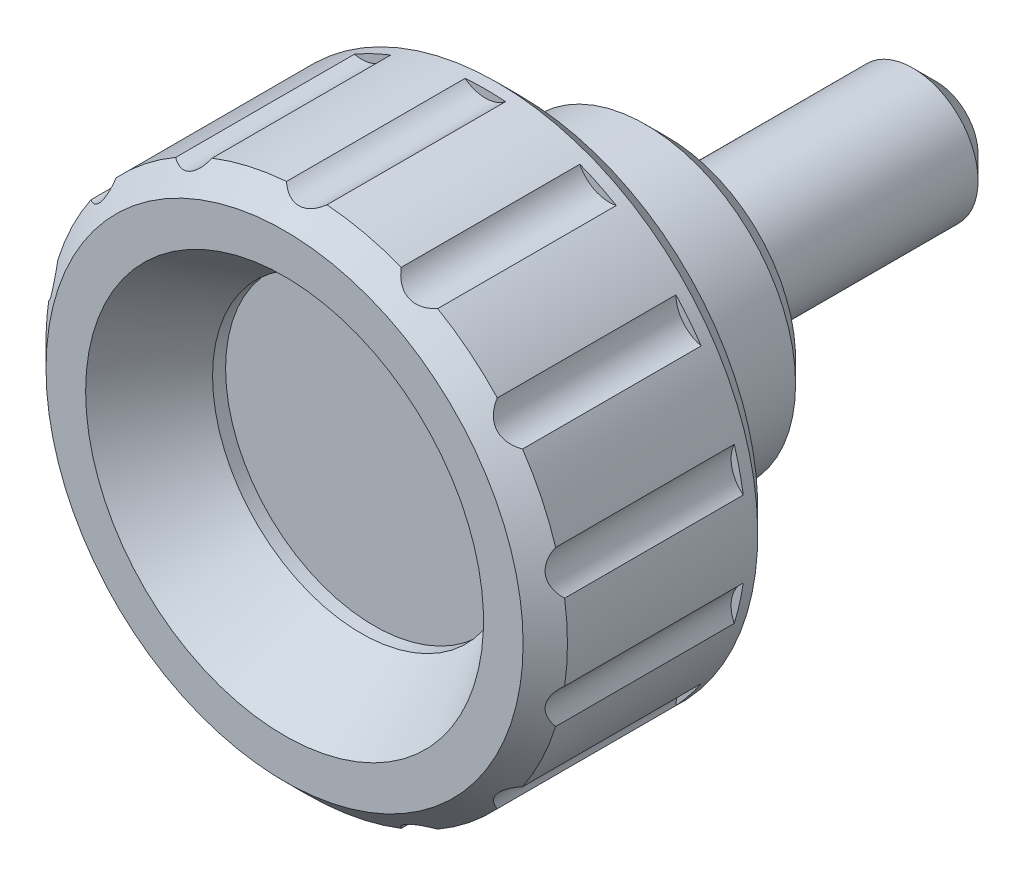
ISO-10303-21;
HEADER;
FILE_DESCRIPTION(('STEP AP214'),'2;1');
FILE_NAME('part.step','',(''),(''),'','','');
FILE_SCHEMA(('AUTOMOTIVE_DESIGN { 1 0 10303 214 1 1 1 1 }'));
ENDSEC;
DATA;
#1=APPLICATION_CONTEXT('core data for automotive mechanical design processes');
#2=APPLICATION_PROTOCOL_DEFINITION('international standard','automotive_design',2000,#1);
#3=PRODUCT_CONTEXT('',#1,'mechanical');
#4=PRODUCT('Part','Part','',(#3));
#5=PRODUCT_RELATED_PRODUCT_CATEGORY('part','',(#4));
#6=PRODUCT_DEFINITION_FORMATION('','',#4);
#7=PRODUCT_DEFINITION_CONTEXT('part definition',#1,'design');
#8=PRODUCT_DEFINITION('design','',#6,#7);
#9=PRODUCT_DEFINITION_SHAPE('','',#8);
#10=(LENGTH_UNIT() NAMED_UNIT(*) SI_UNIT(.MILLI.,.METRE.));
#11=(NAMED_UNIT(*) PLANE_ANGLE_UNIT() SI_UNIT($,.RADIAN.));
#12=(NAMED_UNIT(*) SI_UNIT($,.STERADIAN.) SOLID_ANGLE_UNIT());
#13=UNCERTAINTY_MEASURE_WITH_UNIT(LENGTH_MEASURE(1.E-05),#10,'distance_accuracy_value','');
#14=(GEOMETRIC_REPRESENTATION_CONTEXT(3) GLOBAL_UNCERTAINTY_ASSIGNED_CONTEXT((#13)) GLOBAL_UNIT_ASSIGNED_CONTEXT((#10,
#11,#12)) REPRESENTATION_CONTEXT('',''));
#15=CARTESIAN_POINT('',(0.,0.,0.));
#16=DIRECTION('',(0.,0.,1.));
#17=DIRECTION('',(1.,0.,0.));
#18=AXIS2_PLACEMENT_3D('',#15,#16,#17);
#19=CARTESIAN_POINT('',(3.99999999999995,0.,0.));
#20=DIRECTION('',(0.,0.,-1.));
#21=DIRECTION('',(0.,1.,0.));
#22=AXIS2_PLACEMENT_3D('',#19,#20,#21);
#23=PLANE('',#22);
#24=CARTESIAN_POINT('',(0.,0.,0.));
#25=DIRECTION('',(0.,0.,-1.));
#26=DIRECTION('',(-1.,0.,0.));
#27=AXIS2_PLACEMENT_3D('',#24,#25,#26);
#28=CIRCLE('',#27,3.5);
#29=CARTESIAN_POINT('',(-3.5,0.,0.));
#30=VERTEX_POINT('',#29);
#31=EDGE_CURVE('E276',#30,#30,#28,.F.);
#32=ORIENTED_EDGE('',*,*,#31,.F.);
#33=EDGE_LOOP('',(#32));
#34=FACE_BOUND('',#33,.T.);
#35=CARTESIAN_POINT('',(0.,0.,0.));
#36=DIRECTION('',(0.,0.,-1.));
#37=DIRECTION('',(-1.,0.,0.));
#38=AXIS2_PLACEMENT_3D('',#35,#36,#37);
#39=CIRCLE('',#38,2.5);
#40=CARTESIAN_POINT('',(-2.5,0.,0.));
#41=VERTEX_POINT('',#40);
#42=EDGE_CURVE('E1004',#41,#41,#39,.T.);
#43=ORIENTED_EDGE('',*,*,#42,.F.);
#44=EDGE_LOOP('',(#43));
#45=FACE_BOUND('',#44,.T.);
#46=ADVANCED_FACE('F14',(#34,#45),#23,.T.);
#47=CARTESIAN_POINT('',(0.,0.,0.));
#48=DIRECTION('',(0.,0.,-1.));
#49=DIRECTION('',(0.,1.,0.));
#50=AXIS2_PLACEMENT_3D('',#47,#48,#49);
#51=CYLINDRICAL_SURFACE('',#50,10.);
#52=CARTESIAN_POINT('',(0.,0.,14.15));
#53=DIRECTION('',(0.,0.,-1.));
#54=DIRECTION('',(-1.,0.,0.));
#55=AXIS2_PLACEMENT_3D('',#52,#53,#54);
#56=CIRCLE('',#55,10.);
#57=CARTESIAN_POINT('',(-8.27844244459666,-5.60958025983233,14.15));
#58=VERTEX_POINT('',#57);
#59=CARTESIAN_POINT('',(-9.54727089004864,-2.97483084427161,14.15));
#60=VERTEX_POINT('',#59);
#61=EDGE_CURVE('E227',#58,#60,#56,.T.);
#62=ORIENTED_EDGE('',*,*,#61,.T.);
#63=DIRECTION('',(0.,0.,1.));
#64=VECTOR('',#63,1.);
#65=CARTESIAN_POINT('',(-9.54727089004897,-2.97483084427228,7.3));
#66=LINE('',#65,#64);
#67=CARTESIAN_POINT('',(-9.54727089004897,-2.97483084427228,7.3));
#68=VERTEX_POINT('',#67);
#69=EDGE_CURVE('E235',#68,#60,#66,.T.);
#70=ORIENTED_EDGE('',*,*,#69,.F.);
#71=CARTESIAN_POINT('',(0.,0.,7.3));
#72=DIRECTION('',(0.,0.,1.));
#73=DIRECTION('',(0.,-1.,0.));
#74=AXIS2_PLACEMENT_3D('',#71,#72,#73);
#75=CIRCLE('',#74,10.);
#76=CARTESIAN_POINT('',(-9.89252457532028,-1.46217561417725,7.3));
#77=VERTEX_POINT('',#76);
#78=EDGE_CURVE('E440',#68,#77,#75,.F.);
#79=ORIENTED_EDGE('',*,*,#78,.T.);
#80=DIRECTION('',(0.,0.,1.));
#81=VECTOR('',#80,1.);
#82=CARTESIAN_POINT('',(-9.89252457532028,-1.46217561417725,7.3));
#83=LINE('',#82,#81);
#84=CARTESIAN_POINT('',(-9.89252457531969,-1.46217561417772,14.15));
#85=VERTEX_POINT('',#84);
#86=EDGE_CURVE('E226',#77,#85,#83,.T.);
#87=ORIENTED_EDGE('',*,*,#86,.T.);
#88=CARTESIAN_POINT('',(-9.8925245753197,1.46217561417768,14.15));
#89=VERTEX_POINT('',#88);
#90=EDGE_CURVE('E207',#85,#89,#56,.T.);
#91=ORIENTED_EDGE('',*,*,#90,.T.);
#92=DIRECTION('',(0.,0.,1.));
#93=VECTOR('',#92,1.);
#94=CARTESIAN_POINT('',(-9.89252457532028,1.46217561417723,7.3));
#95=LINE('',#94,#93);
#96=CARTESIAN_POINT('',(-9.89252457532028,1.46217561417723,7.3));
#97=VERTEX_POINT('',#96);
#98=EDGE_CURVE('E224',#97,#89,#95,.T.);
#99=ORIENTED_EDGE('',*,*,#98,.F.);
#100=CARTESIAN_POINT('',(-9.54727089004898,2.97483084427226,7.3));
#101=VERTEX_POINT('',#100);
#102=EDGE_CURVE('E962',#97,#101,#75,.F.);
#103=ORIENTED_EDGE('',*,*,#102,.T.);
#104=DIRECTION('',(0.,0.,1.));
#105=VECTOR('',#104,1.);
#106=CARTESIAN_POINT('',(-9.54727089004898,2.97483084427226,7.3));
#107=LINE('',#106,#105);
#108=CARTESIAN_POINT('',(-9.54727089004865,2.97483084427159,14.15));
#109=VERTEX_POINT('',#108);
#110=EDGE_CURVE('E233',#101,#109,#107,.T.);
#111=ORIENTED_EDGE('',*,*,#110,.T.);
#112=CARTESIAN_POINT('',(-8.27844244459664,5.60958025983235,14.15));
#113=VERTEX_POINT('',#112);
#114=EDGE_CURVE('E210',#109,#113,#56,.T.);
#115=ORIENTED_EDGE('',*,*,#114,.T.);
#116=DIRECTION('',(0.,0.,1.));
#117=VECTOR('',#116,1.);
#118=CARTESIAN_POINT('',(-8.27844244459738,5.60958025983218,7.3));
#119=LINE('',#118,#117);
#120=CARTESIAN_POINT('',(-8.27844244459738,5.60958025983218,7.3));
#121=VERTEX_POINT('',#120);
#122=EDGE_CURVE('E237',#121,#113,#119,.T.);
#123=ORIENTED_EDGE('',*,*,#122,.F.);
#124=CARTESIAN_POINT('',(-7.31106311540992,6.82263557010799,7.3));
#125=VERTEX_POINT('',#124);
#126=EDGE_CURVE('E963',#121,#125,#75,.F.);
#127=ORIENTED_EDGE('',*,*,#126,.T.);
#128=DIRECTION('',(0.,0.,1.));
#129=VECTOR('',#128,1.);
#130=CARTESIAN_POINT('',(-7.31106311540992,6.82263557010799,7.3));
#131=LINE('',#130,#129);
#132=CARTESIAN_POINT('',(-7.31106311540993,6.82263557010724,14.15));
#133=VERTEX_POINT('',#132);
#134=EDGE_CURVE('E243',#125,#133,#131,.T.);
#135=ORIENTED_EDGE('',*,*,#134,.T.);
#136=CARTESIAN_POINT('',(-5.02471325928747,8.64593873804,14.15));
#137=VERTEX_POINT('',#136);
#138=EDGE_CURVE('E972',#133,#137,#56,.T.);
#139=ORIENTED_EDGE('',*,*,#138,.T.);
#140=DIRECTION('',(0.,0.,1.));
#141=VECTOR('',#140,1.);
#142=CARTESIAN_POINT('',(-5.02471325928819,8.64593873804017,7.3));
#143=LINE('',#142,#141);
#144=CARTESIAN_POINT('',(-5.02471325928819,8.64593873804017,7.3));
#145=VERTEX_POINT('',#144);
#146=EDGE_CURVE('E246',#145,#137,#143,.T.);
#147=ORIENTED_EDGE('',*,*,#146,.F.);
#148=CARTESIAN_POINT('',(-3.62680962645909,9.3191336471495,7.3));
#149=VERTEX_POINT('',#148);
#150=EDGE_CURVE('E267',#145,#149,#75,.F.);
#151=ORIENTED_EDGE('',*,*,#150,.T.);
#152=DIRECTION('',(0.,0.,1.));
#153=VECTOR('',#152,1.);
#154=CARTESIAN_POINT('',(-3.62680962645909,9.3191336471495,7.3));
#155=LINE('',#154,#153);
#156=CARTESIAN_POINT('',(-3.62680962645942,9.31913364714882,14.15));
#157=VERTEX_POINT('',#156);
#158=EDGE_CURVE('E249',#149,#157,#155,.T.);
#159=ORIENTED_EDGE('',*,*,#158,.T.);
#160=CARTESIAN_POINT('',(-0.775777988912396,9.96986301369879,14.15));
#161=VERTEX_POINT('',#160);
#162=EDGE_CURVE('E974',#157,#161,#56,.T.);
#163=ORIENTED_EDGE('',*,*,#162,.T.);
#164=DIRECTION('',(0.,0.,1.));
#165=VECTOR('',#164,1.);
#166=CARTESIAN_POINT('',(-0.775777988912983,9.96986301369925,7.3));
#167=LINE('',#166,#165);
#168=CARTESIAN_POINT('',(-0.775777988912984,9.96986301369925,7.3));
#169=VERTEX_POINT('',#168);
#170=EDGE_CURVE('E252',#169,#161,#167,.T.);
#171=ORIENTED_EDGE('',*,*,#170,.F.);
#172=CARTESIAN_POINT('',(0.775777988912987,9.96986301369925,7.3));
#173=VERTEX_POINT('',#172);
#174=EDGE_CURVE('E41',#169,#173,#75,.F.);
#175=ORIENTED_EDGE('',*,*,#174,.T.);
#176=DIRECTION('',(0.,0.,1.));
#177=VECTOR('',#176,1.);
#178=CARTESIAN_POINT('',(0.775777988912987,9.96986301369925,7.3));
#179=LINE('',#178,#177);
#180=CARTESIAN_POINT('',(0.775777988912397,9.96986301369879,14.15));
#181=VERTEX_POINT('',#180);
#182=EDGE_CURVE('E255',#173,#181,#179,.T.);
#183=ORIENTED_EDGE('',*,*,#182,.T.);
#184=CARTESIAN_POINT('',(3.62680962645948,9.3191336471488,14.15));
#185=VERTEX_POINT('',#184);
#186=EDGE_CURVE('E975',#181,#185,#56,.T.);
#187=ORIENTED_EDGE('',*,*,#186,.T.);
#188=DIRECTION('',(0.,0.,1.));
#189=VECTOR('',#188,1.);
#190=CARTESIAN_POINT('',(3.62680962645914,9.31913364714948,7.3));
#191=LINE('',#190,#189);
#192=CARTESIAN_POINT('',(3.62680962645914,9.31913364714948,7.3));
#193=VERTEX_POINT('',#192);
#194=EDGE_CURVE('E263',#193,#185,#191,.T.);
#195=ORIENTED_EDGE('',*,*,#194,.F.);
#196=CARTESIAN_POINT('',(5.02471325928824,8.64593873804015,7.3));
#197=VERTEX_POINT('',#196);
#198=EDGE_CURVE('E268',#193,#197,#75,.F.);
#199=ORIENTED_EDGE('',*,*,#198,.T.);
#200=DIRECTION('',(0.,0.,1.));
#201=VECTOR('',#200,1.);
#202=CARTESIAN_POINT('',(5.02471325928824,8.64593873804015,7.3));
#203=LINE('',#202,#201);
#204=CARTESIAN_POINT('',(5.02471325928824,8.64593873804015,14.15));
#205=VERTEX_POINT('',#204);
#206=EDGE_CURVE('E385',#197,#205,#203,.T.);
#207=ORIENTED_EDGE('',*,*,#206,.T.);
#208=CARTESIAN_POINT('',(7.31106311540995,6.82263557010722,14.15));
#209=VERTEX_POINT('',#208);
#210=EDGE_CURVE('E34',#205,#209,#56,.T.);
#211=ORIENTED_EDGE('',*,*,#210,.T.);
#212=DIRECTION('',(0.,0.,1.));
#213=VECTOR('',#212,1.);
#214=CARTESIAN_POINT('',(7.31106311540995,6.82263557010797,7.3));
#215=LINE('',#214,#213);
#216=CARTESIAN_POINT('',(7.31106311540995,6.82263557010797,7.3));
#217=VERTEX_POINT('',#216);
#218=EDGE_CURVE('E388',#217,#209,#215,.T.);
#219=ORIENTED_EDGE('',*,*,#218,.F.);
#220=CARTESIAN_POINT('',(8.27844244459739,5.60958025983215,7.3));
#221=VERTEX_POINT('',#220);
#222=EDGE_CURVE('E940',#217,#221,#75,.F.);
#223=ORIENTED_EDGE('',*,*,#222,.T.);
#224=DIRECTION('',(0.,0.,1.));
#225=VECTOR('',#224,1.);
#226=CARTESIAN_POINT('',(8.27844244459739,5.60958025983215,7.3));
#227=LINE('',#226,#225);
#228=CARTESIAN_POINT('',(8.27844244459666,5.60958025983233,14.15));
#229=VERTEX_POINT('',#228);
#230=EDGE_CURVE('E391',#221,#229,#227,.T.);
#231=ORIENTED_EDGE('',*,*,#230,.T.);
#232=CARTESIAN_POINT('',(9.54727089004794,2.97483084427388,14.15));
#233=VERTEX_POINT('',#232);
#234=EDGE_CURVE('E977',#229,#233,#56,.T.);
#235=ORIENTED_EDGE('',*,*,#234,.T.);
#236=DIRECTION('',(0.,0.,1.));
#237=VECTOR('',#236,1.);
#238=CARTESIAN_POINT('',(9.54727089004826,2.97483084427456,7.3));
#239=LINE('',#238,#237);
#240=CARTESIAN_POINT('',(9.54727089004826,2.97483084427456,7.3));
#241=VERTEX_POINT('',#240);
#242=EDGE_CURVE('E394',#241,#233,#239,.T.);
#243=ORIENTED_EDGE('',*,*,#242,.F.);
#244=CARTESIAN_POINT('',(9.89252457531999,1.46217561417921,7.3));
#245=VERTEX_POINT('',#244);
#246=EDGE_CURVE('E942',#241,#245,#75,.F.);
#247=ORIENTED_EDGE('',*,*,#246,.T.);
#248=DIRECTION('',(0.,0.,1.));
#249=VECTOR('',#248,1.);
#250=CARTESIAN_POINT('',(9.89252457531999,1.46217561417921,7.3));
#251=LINE('',#250,#249);
#252=CARTESIAN_POINT('',(9.8925245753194,1.46217561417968,14.15));
#253=VERTEX_POINT('',#252);
#254=EDGE_CURVE('E397',#245,#253,#251,.T.);
#255=ORIENTED_EDGE('',*,*,#254,.T.);
#256=CARTESIAN_POINT('',(9.89252457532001,-1.46217561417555,14.15));
#257=VERTEX_POINT('',#256);
#258=EDGE_CURVE('E979',#253,#257,#56,.T.);
#259=ORIENTED_EDGE('',*,*,#258,.T.);
#260=DIRECTION('',(0.,0.,1.));
#261=VECTOR('',#260,1.);
#262=CARTESIAN_POINT('',(9.8925245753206,-1.46217561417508,7.3));
#263=LINE('',#262,#261);
#264=CARTESIAN_POINT('',(9.8925245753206,-1.46217561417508,7.3));
#265=VERTEX_POINT('',#264);
#266=EDGE_CURVE('E400',#265,#257,#263,.T.);
#267=ORIENTED_EDGE('',*,*,#266,.F.);
#268=CARTESIAN_POINT('',(9.54727089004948,-2.97483084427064,7.3));
#269=VERTEX_POINT('',#268);
#270=EDGE_CURVE('E944',#265,#269,#75,.F.);
#271=ORIENTED_EDGE('',*,*,#270,.T.);
#272=DIRECTION('',(0.,0.,1.));
#273=VECTOR('',#272,1.);
#274=CARTESIAN_POINT('',(9.54727089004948,-2.97483084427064,7.3));
#275=LINE('',#274,#273);
#276=CARTESIAN_POINT('',(9.54727089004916,-2.97483084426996,14.15));
#277=VERTEX_POINT('',#276);
#278=EDGE_CURVE('E403',#269,#277,#275,.T.);
#279=ORIENTED_EDGE('',*,*,#278,.T.);
#280=CARTESIAN_POINT('',(8.27844244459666,-5.60958025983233,14.15));
#281=VERTEX_POINT('',#280);
#282=EDGE_CURVE('E981',#277,#281,#56,.T.);
#283=ORIENTED_EDGE('',*,*,#282,.T.);
#284=DIRECTION('',(0.,0.,1.));
#285=VECTOR('',#284,1.);
#286=CARTESIAN_POINT('',(8.27844244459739,-5.60958025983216,7.3));
#287=LINE('',#286,#285);
#288=CARTESIAN_POINT('',(8.27844244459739,-5.60958025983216,7.3));
#289=VERTEX_POINT('',#288);
#290=EDGE_CURVE('E406',#289,#281,#287,.T.);
#291=ORIENTED_EDGE('',*,*,#290,.F.);
#292=CARTESIAN_POINT('',(7.31106311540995,-6.82263557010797,7.3));
#293=VERTEX_POINT('',#292);
#294=EDGE_CURVE('E947',#289,#293,#75,.F.);
#295=ORIENTED_EDGE('',*,*,#294,.T.);
#296=DIRECTION('',(0.,0.,1.));
#297=VECTOR('',#296,1.);
#298=CARTESIAN_POINT('',(7.31106311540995,-6.82263557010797,7.3));
#299=LINE('',#298,#297);
#300=CARTESIAN_POINT('',(7.31106311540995,-6.82263557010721,14.15));
#301=VERTEX_POINT('',#300);
#302=EDGE_CURVE('E409',#293,#301,#299,.T.);
#303=ORIENTED_EDGE('',*,*,#302,.T.);
#304=CARTESIAN_POINT('',(5.02471325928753,-8.64593873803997,14.15));
#305=VERTEX_POINT('',#304);
#306=EDGE_CURVE('E983',#301,#305,#56,.T.);
#307=ORIENTED_EDGE('',*,*,#306,.T.);
#308=DIRECTION('',(0.,0.,1.));
#309=VECTOR('',#308,1.);
#310=CARTESIAN_POINT('',(5.02471325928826,-8.64593873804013,7.3));
#311=LINE('',#310,#309);
#312=CARTESIAN_POINT('',(5.02471325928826,-8.64593873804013,7.3));
#313=VERTEX_POINT('',#312);
#314=EDGE_CURVE('E412',#313,#305,#311,.T.);
#315=ORIENTED_EDGE('',*,*,#314,.F.);
#316=CARTESIAN_POINT('',(3.62680962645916,-9.31913364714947,7.3));
#317=VERTEX_POINT('',#316);
#318=EDGE_CURVE('E950',#313,#317,#75,.F.);
#319=ORIENTED_EDGE('',*,*,#318,.T.);
#320=DIRECTION('',(0.,0.,1.));
#321=VECTOR('',#320,1.);
#322=CARTESIAN_POINT('',(3.62680962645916,-9.31913364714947,7.3));
#323=LINE('',#322,#321);
#324=CARTESIAN_POINT('',(3.62680962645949,-9.31913364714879,14.15));
#325=VERTEX_POINT('',#324);
#326=EDGE_CURVE('E415',#317,#325,#323,.T.);
#327=ORIENTED_EDGE('',*,*,#326,.T.);
#328=CARTESIAN_POINT('',(0.775777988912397,-9.96986301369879,14.15));
#329=VERTEX_POINT('',#328);
#330=EDGE_CURVE('E985',#325,#329,#56,.T.);
#331=ORIENTED_EDGE('',*,*,#330,.T.);
#332=DIRECTION('',(0.,0.,1.));
#333=VECTOR('',#332,1.);
#334=CARTESIAN_POINT('',(0.775777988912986,-9.96986301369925,7.3));
#335=LINE('',#334,#333);
#336=CARTESIAN_POINT('',(0.775777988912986,-9.96986301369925,7.3));
#337=VERTEX_POINT('',#336);
#338=EDGE_CURVE('E418',#337,#329,#335,.T.);
#339=ORIENTED_EDGE('',*,*,#338,.F.);
#340=CARTESIAN_POINT('',(-0.775777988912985,-9.96986301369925,7.3));
#341=VERTEX_POINT('',#340);
#342=EDGE_CURVE('E953',#337,#341,#75,.F.);
#343=ORIENTED_EDGE('',*,*,#342,.T.);
#344=DIRECTION('',(0.,0.,1.));
#345=VECTOR('',#344,1.);
#346=CARTESIAN_POINT('',(-0.775777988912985,-9.96986301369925,7.3));
#347=LINE('',#346,#345);
#348=CARTESIAN_POINT('',(-0.775777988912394,-9.96986301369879,14.15));
#349=VERTEX_POINT('',#348);
#350=EDGE_CURVE('E421',#341,#349,#347,.T.);
#351=ORIENTED_EDGE('',*,*,#350,.T.);
#352=CARTESIAN_POINT('',(-3.62680962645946,-9.3191336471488,14.15));
#353=VERTEX_POINT('',#352);
#354=EDGE_CURVE('E445',#349,#353,#56,.T.);
#355=ORIENTED_EDGE('',*,*,#354,.T.);
#356=DIRECTION('',(0.,0.,1.));
#357=VECTOR('',#356,1.);
#358=CARTESIAN_POINT('',(-3.62680962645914,-9.31913364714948,7.3));
#359=LINE('',#358,#357);
#360=CARTESIAN_POINT('',(-3.62680962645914,-9.31913364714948,7.3));
#361=VERTEX_POINT('',#360);
#362=EDGE_CURVE('E424',#361,#353,#359,.T.);
#363=ORIENTED_EDGE('',*,*,#362,.F.);
#364=CARTESIAN_POINT('',(-5.02471325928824,-8.64593873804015,7.3));
#365=VERTEX_POINT('',#364);
#366=EDGE_CURVE('E956',#361,#365,#75,.F.);
#367=ORIENTED_EDGE('',*,*,#366,.T.);
#368=DIRECTION('',(0.,0.,1.));
#369=VECTOR('',#368,1.);
#370=CARTESIAN_POINT('',(-5.02471325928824,-8.64593873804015,7.3));
#371=LINE('',#370,#369);
#372=CARTESIAN_POINT('',(-5.02471325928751,-8.64593873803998,14.15));
#373=VERTEX_POINT('',#372);
#374=EDGE_CURVE('E427',#365,#373,#371,.T.);
#375=ORIENTED_EDGE('',*,*,#374,.T.);
#376=CARTESIAN_POINT('',(-7.31106311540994,-6.82263557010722,14.15));
#377=VERTEX_POINT('',#376);
#378=EDGE_CURVE('E443',#373,#377,#56,.T.);
#379=ORIENTED_EDGE('',*,*,#378,.T.);
#380=DIRECTION('',(0.,0.,1.));
#381=VECTOR('',#380,1.);
#382=CARTESIAN_POINT('',(-7.31106311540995,-6.82263557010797,7.3));
#383=LINE('',#382,#381);
#384=CARTESIAN_POINT('',(-7.31106311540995,-6.82263557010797,7.3));
#385=VERTEX_POINT('',#384);
#386=EDGE_CURVE('E430',#385,#377,#383,.T.);
#387=ORIENTED_EDGE('',*,*,#386,.F.);
#388=CARTESIAN_POINT('',(-8.27844244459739,-5.60958025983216,7.3));
#389=VERTEX_POINT('',#388);
#390=EDGE_CURVE('E959',#385,#389,#75,.F.);
#391=ORIENTED_EDGE('',*,*,#390,.T.);
#392=DIRECTION('',(0.,0.,1.));
#393=VECTOR('',#392,1.);
#394=CARTESIAN_POINT('',(-8.27844244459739,-5.60958025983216,7.3));
#395=LINE('',#394,#393);
#396=EDGE_CURVE('E433',#389,#58,#395,.T.);
#397=ORIENTED_EDGE('',*,*,#396,.T.);
#398=EDGE_LOOP('',(#62,#70,#79,#87,#91,#99,#103,#111,#115,#123,#127,#135,#139,#147,#151,#159,
#163,#171,#175,#183,#187,#195,#199,#207,#211,#219,#223,#231,#235,#243,#247,#255,#259,#267,#271,
#279,#283,#291,#295,#303,#307,#315,#319,#327,#331,#339,#343,#351,#355,#363,#367,#375,#379,#387,
#391,#397));
#399=FACE_BOUND('',#398,.T.);
#400=CARTESIAN_POINT('',(0.,0.,6.85));
#401=DIRECTION('',(0.,0.,-1.));
#402=DIRECTION('',(0.,1.,0.));
#403=AXIS2_PLACEMENT_3D('',#400,#401,#402);
#404=CIRCLE('',#403,10.);
#405=CARTESIAN_POINT('',(0.,10.,6.85));
#406=VERTEX_POINT('',#405);
#407=EDGE_CURVE('E259',#406,#406,#404,.T.);
#408=ORIENTED_EDGE('',*,*,#407,.F.);
#409=EDGE_LOOP('',(#408));
#410=FACE_BOUND('',#409,.T.);
#411=ADVANCED_FACE('F221',(#399,#410),#51,.T.);
#412=CARTESIAN_POINT('',(9.15,0.,6.));
#413=DIRECTION('',(0.,0.,-1.));
#414=DIRECTION('',(0.,1.,0.));
#415=AXIS2_PLACEMENT_3D('',#412,#413,#414);
#416=PLANE('',#415);
#417=CARTESIAN_POINT('',(0.,0.,6.));
#418=DIRECTION('',(0.,0.,-1.));
#419=DIRECTION('',(0.,1.,0.));
#420=AXIS2_PLACEMENT_3D('',#417,#418,#419);
#421=CIRCLE('',#420,9.15);
#422=CARTESIAN_POINT('',(0.,9.15,6.));
#423=VERTEX_POINT('',#422);
#424=EDGE_CURVE('E262',#423,#423,#421,.T.);
#425=ORIENTED_EDGE('',*,*,#424,.T.);
#426=EDGE_LOOP('',(#425));
#427=FACE_BOUND('',#426,.T.);
#428=CARTESIAN_POINT('',(0.,0.,6.));
#429=DIRECTION('',(0.,0.,-1.));
#430=DIRECTION('',(-1.,0.,0.));
#431=AXIS2_PLACEMENT_3D('',#428,#429,#430);
#432=CIRCLE('',#431,5.75);
#433=CARTESIAN_POINT('',(-5.75,0.,6.));
#434=VERTEX_POINT('',#433);
#435=EDGE_CURVE('E279',#434,#434,#432,.T.);
#436=ORIENTED_EDGE('',*,*,#435,.F.);
#437=EDGE_LOOP('',(#436));
#438=FACE_BOUND('',#437,.T.);
#439=ADVANCED_FACE('F311',(#427,#438),#416,.T.);
#440=CARTESIAN_POINT('',(0.,0.,6.));
#441=DIRECTION('',(0.,0.,1.));
#442=DIRECTION('',(0.,-1.,0.));
#443=AXIS2_PLACEMENT_3D('',#440,#441,#442);
#444=CONICAL_SURFACE('',#443,9.15,0.785398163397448);
#445=ORIENTED_EDGE('',*,*,#407,.T.);
#446=EDGE_LOOP('',(#445));
#447=FACE_BOUND('',#446,.T.);
#448=ORIENTED_EDGE('',*,*,#424,.F.);
#449=EDGE_LOOP('',(#448));
#450=FACE_BOUND('',#449,.T.);
#451=ADVANCED_FACE('F577',(#447,#450),#444,.T.);
#452=CARTESIAN_POINT('',(0.,10.9500000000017,7.3));
#453=DIRECTION('',(0.,0.,1.));
#454=DIRECTION('',(0.,-1.,0.));
#455=AXIS2_PLACEMENT_3D('',#452,#453,#454);
#456=CYLINDRICAL_SURFACE('',#455,1.25);
#457=CARTESIAN_POINT('',(0.775977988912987,9.97002134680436,14.1498266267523));
#458=CARTESIAN_POINT('',(0.734586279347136,9.93724261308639,14.1857107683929));
#459=CARTESIAN_POINT('',(0.68995529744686,9.90618033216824,14.2199249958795));
#460=CARTESIAN_POINT('',(0.593942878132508,9.84868428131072,14.2835331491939));
#461=CARTESIAN_POINT('',(0.542499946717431,9.82229852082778,14.3128768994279));
#462=CARTESIAN_POINT('',(0.443151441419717,9.78017982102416,14.3598826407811));
#463=CARTESIAN_POINT('',(0.396256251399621,9.76338583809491,14.3786950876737));
#464=CARTESIAN_POINT('',(0.299067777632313,9.73525526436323,14.4102700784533));
#465=CARTESIAN_POINT('',(0.248787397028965,9.7238991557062,14.4230542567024));
#466=CARTESIAN_POINT('',(0.145474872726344,9.70738511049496,14.4416620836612));
#467=CARTESIAN_POINT('',(0.0924231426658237,9.70228010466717,14.4474262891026));
#468=CARTESIAN_POINT('',(-0.0142000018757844,9.69894396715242,14.4511919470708));
#469=CARTESIAN_POINT('',(-0.0677715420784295,9.70071454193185,14.4491914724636));
#470=CARTESIAN_POINT('',(-0.167200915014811,9.71034496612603,14.4383278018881));
#471=CARTESIAN_POINT('',(-0.213227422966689,9.71746747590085,14.4302956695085));
#472=CARTESIAN_POINT('',(-0.30302476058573,9.7364164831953,14.4089716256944));
#473=CARTESIAN_POINT('',(-0.346794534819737,9.74824515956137,14.3956772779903));
#474=CARTESIAN_POINT('',(-0.445997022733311,9.78073865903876,14.3592589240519));
#475=CARTESIAN_POINT('',(-0.500224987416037,9.80304471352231,14.3343253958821));
#476=CARTESIAN_POINT('',(-0.602533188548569,9.8533143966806,14.2784064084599));
#477=CARTESIAN_POINT('',(-0.650605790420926,9.88128494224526,14.2474135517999));
#478=CARTESIAN_POINT('',(-0.723578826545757,9.93016500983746,14.1935419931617));
#479=CARTESIAN_POINT('',(-0.750378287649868,9.94975642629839,14.1720143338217));
#480=CARTESIAN_POINT('',(-0.775977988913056,9.97002134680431,14.1498266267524));
#481=B_SPLINE_CURVE_WITH_KNOTS('',3,(#457,#458,#459,#460,#461,#462,#463,#464,#465,#466,#467,
#468,#469,#470,#471,#472,#473,#474,#475,#476,#477,#478,#479,#480),.UNSPECIFIED.,.F.,.F.,(4,2,2,
2,2,2,2,2,2,2,2,4),(0.,0.191836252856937,0.385540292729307,0.544632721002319,0.703149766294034,
0.86299996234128,1.022889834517,1.16405643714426,1.3052884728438,1.49538818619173,
1.68572144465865,1.80423553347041),.UNSPECIFIED.);
#482=EDGE_CURVE('E559',#181,#161,#481,.T.);
#483=ORIENTED_EDGE('',*,*,#482,.F.);
#484=ORIENTED_EDGE('',*,*,#182,.F.);
#485=CARTESIAN_POINT('',(0.,10.9500000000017,7.3));
#486=DIRECTION('',(0.,0.,-1.));
#487=DIRECTION('',(0.,-1.,0.));
#488=AXIS2_PLACEMENT_3D('',#485,#486,#487);
#489=CIRCLE('',#488,1.25);
#490=EDGE_CURVE('E341',#173,#169,#489,.T.);
#491=ORIENTED_EDGE('',*,*,#490,.T.);
#492=ORIENTED_EDGE('',*,*,#170,.T.);
#493=EDGE_LOOP('',(#483,#484,#491,#492));
#494=FACE_BOUND('',#493,.T.);
#495=ADVANCED_FACE('F573',(#494),#456,.F.);
#496=CARTESIAN_POINT('',(0.,0.,7.3));
#497=DIRECTION('',(0.,0.,1.));
#498=DIRECTION('',(0.,-1.,0.));
#499=AXIS2_PLACEMENT_3D('',#496,#497,#498);
#500=PLANE('',#499);
#501=ORIENTED_EDGE('',*,*,#490,.F.);
#502=ORIENTED_EDGE('',*,*,#174,.F.);
#503=EDGE_LOOP('',(#501,#502));
#504=FACE_BOUND('',#503,.T.);
#505=ADVANCED_FACE('F569',(#504),#500,.T.);
#506=CARTESIAN_POINT('',(-4.75102694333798,9.86560910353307,7.3));
#507=DIRECTION('',(0.,0.,1.));
#508=DIRECTION('',(0.,-1.,0.));
#509=AXIS2_PLACEMENT_3D('',#506,#507,#508);
#510=CYLINDRICAL_SURFACE('',#509,1.25);
#511=CARTESIAN_POINT('',(-3.62668101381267,9.31939831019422,14.1498));
#512=CARTESIAN_POINT('',(-3.64975063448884,9.27190450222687,14.185686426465));
#513=CARTESIAN_POINT('',(-3.67648365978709,9.22455160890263,14.2199029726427));
#514=CARTESIAN_POINT('',(-3.73804039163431,9.13108688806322,14.2835157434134));
#515=CARTESIAN_POINT('',(-3.77294034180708,9.08499163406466,14.3128617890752));
#516=CARTESIAN_POINT('',(-3.84417515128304,9.00393496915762,14.3598710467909));
#517=CARTESIAN_POINT('',(-3.87913908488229,8.96845594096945,14.3786848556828));
#518=CARTESIAN_POINT('',(-3.95449665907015,8.90094031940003,14.4102625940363));
#519=CARTESIAN_POINT('',(-3.99487020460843,8.86889173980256,14.4230481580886));
#520=CARTESIAN_POINT('',(-4.08078621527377,8.80918487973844,14.4416586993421));
#521=CARTESIAN_POINT('',(-4.12636930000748,8.78156579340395,14.447424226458));
#522=CARTESIAN_POINT('',(-4.2209865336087,8.73229533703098,14.4511922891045));
#523=CARTESIAN_POINT('',(-4.27002153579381,8.71064544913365,14.4491928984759));
#524=CARTESIAN_POINT('',(-4.36378339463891,8.67617932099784,14.4383310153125));
#525=CARTESIAN_POINT('',(-4.4083422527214,8.66262548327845,14.4302997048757));
#526=CARTESIAN_POINT('',(-4.49746880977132,8.64073471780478,14.408977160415));
#527=CARTESIAN_POINT('',(-4.54203650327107,8.63240020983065,14.3956834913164));
#528=CARTESIAN_POINT('',(-4.64551253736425,8.61863194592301,14.35926702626));
#529=CARTESIAN_POINT('',(-4.70404762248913,8.61519944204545,14.3343348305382));
#530=CARTESIAN_POINT('',(-4.81803389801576,8.6160989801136,14.2784184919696));
#531=CARTESIAN_POINT('',(-4.87348120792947,8.62044057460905,14.2474269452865));
#532=CARTESIAN_POINT('',(-4.96045702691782,8.63281949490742,14.1935439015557));
#533=CARTESIAN_POINT('',(-4.99312357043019,8.63884697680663,14.1720023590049));
#534=CARTESIAN_POINT('',(-5.02500036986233,8.6460031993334,14.1498));
#535=B_SPLINE_CURVE_WITH_KNOTS('',3,(#511,#512,#513,#514,#515,#516,#517,#518,#519,#520,#521,
#522,#523,#524,#525,#526,#527,#528,#529,#530,#531,#532,#533,#534),.UNSPECIFIED.,.F.,.F.,(4,2,2,
2,2,2,2,2,2,2,2,4),(0.,0.191843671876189,0.385555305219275,0.544650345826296,0.70316998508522,
0.863022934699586,1.02291553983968,1.16408261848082,1.305315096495,1.49541104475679,
1.68574073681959,1.80433015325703),.UNSPECIFIED.);
#536=EDGE_CURVE('E553',#157,#137,#535,.T.);
#537=ORIENTED_EDGE('',*,*,#536,.F.);
#538=ORIENTED_EDGE('',*,*,#158,.F.);
#539=CARTESIAN_POINT('',(-4.75102694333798,9.86560910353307,7.3));
#540=DIRECTION('',(0.,0.,-1.));
#541=DIRECTION('',(0.,-1.,0.));
#542=AXIS2_PLACEMENT_3D('',#539,#540,#541);
#543=CIRCLE('',#542,1.25);
#544=EDGE_CURVE('E343',#149,#145,#543,.T.);
#545=ORIENTED_EDGE('',*,*,#544,.T.);
#546=ORIENTED_EDGE('',*,*,#146,.T.);
#547=EDGE_LOOP('',(#537,#538,#545,#546));
#548=FACE_BOUND('',#547,.T.);
#549=ADVANCED_FACE('F565',(#548),#510,.F.);
#550=ORIENTED_EDGE('',*,*,#544,.F.);
#551=ORIENTED_EDGE('',*,*,#150,.F.);
#552=EDGE_LOOP('',(#550,#551));
#553=FACE_BOUND('',#552,.T.);
#554=ADVANCED_FACE('F568',(#553),#500,.T.);
#555=CARTESIAN_POINT('',(-8.56105473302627,6.82721333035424,7.3));
#556=DIRECTION('',(0.,0.,1.));
#557=DIRECTION('',(0.,-1.,0.));
#558=AXIS2_PLACEMENT_3D('',#555,#556,#557);
#559=CYLINDRICAL_SURFACE('',#558,1.25);
#560=CARTESIAN_POINT('',(-7.31106207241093,6.82292982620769,14.1498));
#561=CARTESIAN_POINT('',(-7.31124029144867,6.77012985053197,14.185686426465));
#562=CARTESIAN_POINT('',(-7.31478026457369,6.7158673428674,14.2199029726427));
#563=CARTESIAN_POINT('',(-7.32968814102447,6.60495007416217,14.2835157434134));
#564=CARTESIAN_POINT('',(-7.34113192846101,6.54827716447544,14.3128617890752));
#565=CARTESIAN_POINT('',(-7.37014310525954,6.44434000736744,14.3598710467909));
#566=CARTESIAN_POINT('',(-7.38625074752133,6.39720422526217,14.3786848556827));
#567=CARTESIAN_POINT('',(-7.42485164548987,6.30367832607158,14.4102625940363));
#568=CARTESIAN_POINT('',(-7.44732159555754,6.25728612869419,14.4230481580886));
#569=CARTESIAN_POINT('',(-7.4988234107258,6.16621454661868,14.4416586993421));
#570=CARTESIAN_POINT('',(-7.52790887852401,6.1215528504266,14.447424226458));
#571=CARTESIAN_POINT('',(-7.59177841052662,6.03610882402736,14.4511922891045));
#572=CARTESIAN_POINT('',(-7.62656388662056,5.99532745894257,14.449192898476));
#573=CARTESIAN_POINT('',(-7.69608610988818,5.92359280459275,14.4383310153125));
#574=CARTESIAN_POINT('',(-7.73035146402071,5.89204785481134,14.4302997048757));
#575=CARTESIAN_POINT('',(-7.80115367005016,5.83365439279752,14.408977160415));
#576=CARTESIAN_POINT('',(-7.83769156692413,5.80680806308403,14.3956834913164));
#577=CARTESIAN_POINT('',(-7.92494642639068,5.74950671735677,14.35926702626));
#578=CARTESIAN_POINT('',(-7.97619540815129,5.72101671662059,14.3343348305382));
#579=CARTESIAN_POINT('',(-8.07928378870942,5.67237038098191,14.2784184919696));
#580=CARTESIAN_POINT('',(-8.13112383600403,5.65222433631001,14.2474269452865));
#581=CARTESIAN_POINT('',(-8.21485735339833,5.62563996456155,14.1935439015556));
#582=CARTESIAN_POINT('',(-8.24690411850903,5.61689705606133,14.1720023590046));
#583=CARTESIAN_POINT('',(-8.27872909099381,5.60951376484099,14.1497999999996));
#584=B_SPLINE_CURVE_WITH_KNOTS('',3,(#560,#561,#562,#563,#564,#565,#566,#567,#568,#569,#570,
#571,#572,#573,#574,#575,#576,#577,#578,#579,#580,#581,#582,#583),.UNSPECIFIED.,.F.,.F.,(4,2,2,
2,2,2,2,2,2,2,2,4),(0.,0.191843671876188,0.385555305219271,0.544650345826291,0.703169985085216,
0.863022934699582,1.02291553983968,1.16408261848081,1.30531509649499,1.49541104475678,
1.68574073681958,1.80433015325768),.UNSPECIFIED.);
#585=EDGE_CURVE('E214',#133,#113,#584,.T.);
#586=ORIENTED_EDGE('',*,*,#585,.F.);
#587=ORIENTED_EDGE('',*,*,#134,.F.);
#588=CARTESIAN_POINT('',(-8.56105473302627,6.82721333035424,7.3));
#589=DIRECTION('',(0.,0.,-1.));
#590=DIRECTION('',(0.,-1.,0.));
#591=AXIS2_PLACEMENT_3D('',#588,#589,#590);
#592=CIRCLE('',#591,1.25);
#593=EDGE_CURVE('E350',#125,#121,#592,.T.);
#594=ORIENTED_EDGE('',*,*,#593,.T.);
#595=ORIENTED_EDGE('',*,*,#122,.T.);
#596=EDGE_LOOP('',(#586,#587,#594,#595));
#597=FACE_BOUND('',#596,.T.);
#598=ADVANCED_FACE('F571',(#597),#559,.F.);
#599=ORIENTED_EDGE('',*,*,#593,.F.);
#600=ORIENTED_EDGE('',*,*,#126,.F.);
#601=EDGE_LOOP('',(#599,#600));
#602=FACE_BOUND('',#601,.T.);
#603=ADVANCED_FACE('F635',(#602),#500,.T.);
#604=CARTESIAN_POINT('',(-10.6754606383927,2.43660422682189,7.3));
#605=DIRECTION('',(0.,0.,1.));
#606=DIRECTION('',(0.,-1.,0.));
#607=AXIS2_PLACEMENT_3D('',#604,#605,#606);
#608=CYLINDRICAL_SURFACE('',#607,1.25);
#609=CARTESIAN_POINT('',(-9.54736632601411,2.97503084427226,14.1498493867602));
#610=CARTESIAN_POINT('',(-9.52462174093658,2.9273834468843,14.1857315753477));
#611=CARTESIAN_POINT('',(-9.50427134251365,2.87696010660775,14.2199438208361));
#612=CARTESIAN_POINT('',(-9.46958497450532,2.77056257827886,14.2835480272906));
#613=CARTESIAN_POINT('',(-9.45530948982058,2.71453912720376,14.3128898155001));
#614=CARTESIAN_POINT('',(-9.43635639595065,2.60831065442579,14.3598925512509));
#615=CARTESIAN_POINT('',(-9.43041966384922,2.55885444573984,14.3787038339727));
#616=CARTESIAN_POINT('',(-9.42462285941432,2.45784375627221,14.4102764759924));
#617=CARTESIAN_POINT('',(-9.42474088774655,2.40629751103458,14.4230594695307));
#618=CARTESIAN_POINT('',(-9.43163191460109,2.30190179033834,14.4416649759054));
#619=CARTESIAN_POINT('',(-9.43846086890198,2.24904500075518,14.4474280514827));
#620=CARTESIAN_POINT('',(-9.45893571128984,2.14435457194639,14.4511916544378));
#621=CARTESIAN_POINT('',(-9.47258329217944,2.09252119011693,14.4491902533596));
#622=CARTESIAN_POINT('',(-9.50409843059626,1.99772918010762,14.4383250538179));
#623=CARTESIAN_POINT('',(-9.52128475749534,1.95444204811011,14.4302922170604));
#624=CARTESIAN_POINT('',(-9.55974139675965,1.8711137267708,14.4089668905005));
#625=CARTESIAN_POINT('',(-9.58101359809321,1.83107405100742,14.3956719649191));
#626=CARTESIAN_POINT('',(-9.63476844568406,1.7415896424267,14.3592520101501));
#627=CARTESIAN_POINT('',(-9.66858315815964,1.69368480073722,14.3343173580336));
#628=CARTESIAN_POINT('',(-9.74036028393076,1.60512785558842,14.2783961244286));
#629=CARTESIAN_POINT('',(-9.77832774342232,1.56448473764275,14.2474021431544));
#630=CARTESIAN_POINT('',(-9.84222639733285,1.50421436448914,14.1935250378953));
#631=CARTESIAN_POINT('',(-9.86729531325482,1.48244282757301,14.1719926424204));
#632=CARTESIAN_POINT('',(-9.89275398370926,1.46199133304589,14.1497999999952));
#633=B_SPLINE_CURVE_WITH_KNOTS('',3,(#609,#610,#611,#612,#613,#614,#615,#616,#617,#618,#619,
#620,#621,#622,#623,#624,#625,#626,#627,#628,#629,#630,#631,#632),.UNSPECIFIED.,.F.,.F.,(4,2,2,
2,2,2,2,2,2,2,2,4),(0.,0.191829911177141,0.385527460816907,0.54461765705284,0.703132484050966,
0.862980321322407,1.02286786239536,1.16403407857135,1.30526571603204,1.49536852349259,
1.68570495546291,1.80424243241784),.UNSPECIFIED.);
#634=EDGE_CURVE('E203',#109,#89,#633,.T.);
#635=ORIENTED_EDGE('',*,*,#634,.F.);
#636=ORIENTED_EDGE('',*,*,#110,.F.);
#637=CARTESIAN_POINT('',(-10.6754606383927,2.43660422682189,7.3));
#638=DIRECTION('',(0.,0.,-1.));
#639=DIRECTION('',(0.,-1.,0.));
#640=AXIS2_PLACEMENT_3D('',#637,#638,#639);
#641=CIRCLE('',#640,1.25);
#642=EDGE_CURVE('E232',#101,#97,#641,.T.);
#643=ORIENTED_EDGE('',*,*,#642,.T.);
#644=ORIENTED_EDGE('',*,*,#98,.T.);
#645=EDGE_LOOP('',(#635,#636,#643,#644));
#646=FACE_BOUND('',#645,.T.);
#647=ADVANCED_FACE('F230',(#646),#608,.F.);
#648=ORIENTED_EDGE('',*,*,#642,.F.);
#649=ORIENTED_EDGE('',*,*,#102,.F.);
#650=EDGE_LOOP('',(#648,#649));
#651=FACE_BOUND('',#650,.T.);
#652=ADVANCED_FACE('F650',(#651),#500,.T.);
#653=CARTESIAN_POINT('',(-10.6754606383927,-2.43660422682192,7.3));
#654=DIRECTION('',(0.,0.,1.));
#655=DIRECTION('',(0.,-1.,0.));
#656=AXIS2_PLACEMENT_3D('',#653,#654,#655);
#657=CYLINDRICAL_SURFACE('',#656,1.25);
#658=CARTESIAN_POINT('',(-9.89275398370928,-1.46199133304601,14.1497999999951));
#659=CARTESIAN_POINT('',(-9.85158441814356,-1.49505091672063,14.185686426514));
#660=CARTESIAN_POINT('',(-9.81136741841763,-1.53165069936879,14.2199029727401));
#661=CARTESIAN_POINT('',(-9.73394371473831,-1.61246193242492,14.283515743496));
#662=CARTESIAN_POINT('',(-9.69677013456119,-1.65674402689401,14.3128617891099));
#663=CARTESIAN_POINT('',(-9.63359696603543,-1.74422963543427,14.3598710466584));
#664=CARTESIAN_POINT('',(-9.60678767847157,-1.78621177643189,14.3786848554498));
#665=CARTESIAN_POINT('',(-9.55773345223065,-1.87470361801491,14.4102625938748));
#666=CARTESIAN_POINT('',(-9.53547235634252,-1.92119639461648,14.4230481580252));
#667=CARTESIAN_POINT('',(-9.49638058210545,-2.01824433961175,14.4416586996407));
#668=CARTESIAN_POINT('',(-9.47959715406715,-2.06883038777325,14.4474242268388));
#669=CARTESIAN_POINT('',(-9.45261632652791,-2.17203907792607,14.4511922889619));
#670=CARTESIAN_POINT('',(-9.44242056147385,-2.22466222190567,14.4491928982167));
#671=CARTESIAN_POINT('',(-9.42968254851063,-2.32374270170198,14.438331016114));
#672=CARTESIAN_POINT('',(-9.42638381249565,-2.37020038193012,14.4302997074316));
#673=CARTESIAN_POINT('',(-9.42487441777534,-2.46196350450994,14.4089771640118));
#674=CARTESIAN_POINT('',(-9.42666611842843,-2.50726840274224,14.3956834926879));
#675=CARTESIAN_POINT('',(-9.43626864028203,-2.61121384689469,14.3592670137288));
#676=CARTESIAN_POINT('',(-9.44594748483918,-2.66904517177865,14.3343348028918));
#677=CARTESIAN_POINT('',(-9.47218881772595,-2.77997341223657,14.2784184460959));
#678=CARTESIAN_POINT('',(-9.48875974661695,-2.83306442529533,14.2474269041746));
#679=CARTESIAN_POINT('',(-9.52017328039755,-2.9150816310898,14.1935592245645));
#680=CARTESIAN_POINT('',(-9.53330808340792,-2.94556603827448,14.1720342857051));
#681=CARTESIAN_POINT('',(-9.54736632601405,-2.97503084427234,14.1498493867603));
#682=B_SPLINE_CURVE_WITH_KNOTS('',3,(#658,#659,#660,#661,#662,#663,#664,#665,#666,#667,#668,
#669,#670,#671,#672,#673,#674,#675,#676,#677,#678,#679,#680,#681),.UNSPECIFIED.,.F.,.F.,(4,2,2,
2,2,2,2,2,2,2,2,4),(0.,0.191843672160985,0.385555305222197,0.544650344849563,0.703169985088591,
0.863022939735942,1.02291553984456,1.16408259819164,1.30531509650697,1.49541116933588,
1.68574073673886,1.80424237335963),.UNSPECIFIED.);
#683=EDGE_CURVE('E215',#85,#60,#682,.T.);
#684=ORIENTED_EDGE('',*,*,#683,.F.);
#685=ORIENTED_EDGE('',*,*,#86,.F.);
#686=CARTESIAN_POINT('',(-10.6754606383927,-2.43660422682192,7.3));
#687=DIRECTION('',(0.,0.,-1.));
#688=DIRECTION('',(0.,-1.,0.));
#689=AXIS2_PLACEMENT_3D('',#686,#687,#688);
#690=CIRCLE('',#689,1.25);
#691=EDGE_CURVE('E354',#77,#68,#690,.T.);
#692=ORIENTED_EDGE('',*,*,#691,.T.);
#693=ORIENTED_EDGE('',*,*,#69,.T.);
#694=EDGE_LOOP('',(#684,#685,#692,#693));
#695=FACE_BOUND('',#694,.T.);
#696=ADVANCED_FACE('F438',(#695),#657,.F.);
#697=ORIENTED_EDGE('',*,*,#691,.F.);
#698=ORIENTED_EDGE('',*,*,#78,.F.);
#699=EDGE_LOOP('',(#697,#698));
#700=FACE_BOUND('',#699,.T.);
#701=ADVANCED_FACE('F664',(#700),#500,.T.);
#702=CARTESIAN_POINT('',(-8.56105473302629,-6.82721333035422,7.3));
#703=DIRECTION('',(0.,0.,1.));
#704=DIRECTION('',(0.,-1.,0.));
#705=AXIS2_PLACEMENT_3D('',#702,#703,#704);
#706=CYLINDRICAL_SURFACE('',#705,1.25);
#707=CARTESIAN_POINT('',(-8.27872909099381,-5.60951376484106,14.1497999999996));
#708=CARTESIAN_POINT('',(-8.22729257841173,-5.62143661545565,14.1856864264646));
#709=CARTESIAN_POINT('',(-8.17517826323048,-5.63696237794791,14.2199029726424));
#710=CARTESIAN_POINT('',(-8.07035923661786,-5.67617789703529,14.2835157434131));
#711=CARTESIAN_POINT('',(-8.01765371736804,-5.69994567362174,14.3128617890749));
#712=CARTESIAN_POINT('',(-7.92277807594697,-5.75135767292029,14.3598710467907));
#713=CARTESIAN_POINT('',(-7.88040837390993,-5.77755016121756,14.3786848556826));
#714=CARTESIAN_POINT('',(-7.79781687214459,-5.83599472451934,14.4102625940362));
#715=CARTESIAN_POINT('',(-7.75758785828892,-5.86822454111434,14.4230481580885));
#716=CARTESIAN_POINT('',(-7.68025986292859,-5.93870043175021,14.4416586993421));
#717=CARTESIAN_POINT('',(-7.64319005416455,-5.97699482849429,14.447424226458));
#718=CARTESIAN_POINT('',(-7.57410059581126,-6.05827610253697,14.4511922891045));
#719=CARTESIAN_POINT('',(-7.54208220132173,-6.10126414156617,14.449192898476));
#720=CARTESIAN_POINT('',(-7.48761623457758,-6.18500575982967,14.4383310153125));
#721=CARTESIAN_POINT('',(-7.46448694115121,-6.22543142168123,14.4302997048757));
#722=CARTESIAN_POINT('',(-7.42331249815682,-6.30745223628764,14.408977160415));
#723=CARTESIAN_POINT('',(-7.40526970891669,-6.34904792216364,14.3956834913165));
#724=CARTESIAN_POINT('',(-7.3688210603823,-6.44686586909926,14.3592670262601));
#725=CARTESIAN_POINT('',(-7.35244933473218,-6.50316955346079,14.3343348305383));
#726=CARTESIAN_POINT('',(-7.32796198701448,-6.61449812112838,14.2784184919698));
#727=CARTESIAN_POINT('',(-7.3198565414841,-6.66952134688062,14.2474269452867));
#728=CARTESIAN_POINT('',(-7.31257115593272,-6.7570710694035,14.1935439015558));
#729=CARTESIAN_POINT('',(-7.31117852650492,-6.79025983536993,14.172002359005));
#730=CARTESIAN_POINT('',(-7.31106207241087,-6.8229298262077,14.1498));
#731=B_SPLINE_CURVE_WITH_KNOTS('',3,(#707,#708,#709,#710,#711,#712,#713,#714,#715,#716,#717,
#718,#719,#720,#721,#722,#723,#724,#725,#726,#727,#728,#729,#730),.UNSPECIFIED.,.F.,.F.,(4,2,2,
2,2,2,2,2,2,2,2,4),(0.,0.191843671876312,0.38555530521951,0.544650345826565,0.703169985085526,
0.863022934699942,1.02291553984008,1.16408261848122,1.30531509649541,1.49541104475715,
1.68574073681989,1.8043301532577),.UNSPECIFIED.);
#732=EDGE_CURVE('E527',#58,#377,#731,.T.);
#733=ORIENTED_EDGE('',*,*,#732,.F.);
#734=ORIENTED_EDGE('',*,*,#396,.F.);
#735=CARTESIAN_POINT('',(-8.56105473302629,-6.82721333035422,7.3));
#736=DIRECTION('',(0.,0.,-1.));
#737=DIRECTION('',(0.,-1.,0.));
#738=AXIS2_PLACEMENT_3D('',#735,#736,#737);
#739=CIRCLE('',#738,1.25);
#740=EDGE_CURVE('E357',#389,#385,#739,.T.);
#741=ORIENTED_EDGE('',*,*,#740,.T.);
#742=ORIENTED_EDGE('',*,*,#386,.T.);
#743=EDGE_LOOP('',(#733,#734,#741,#742));
#744=FACE_BOUND('',#743,.T.);
#745=ADVANCED_FACE('F677',(#744),#706,.F.);
#746=ORIENTED_EDGE('',*,*,#740,.F.);
#747=ORIENTED_EDGE('',*,*,#390,.F.);
#748=EDGE_LOOP('',(#746,#747));
#749=FACE_BOUND('',#748,.T.);
#750=ADVANCED_FACE('F679',(#749),#500,.T.);
#751=CARTESIAN_POINT('',(-4.75102694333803,-9.86560910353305,7.3));
#752=DIRECTION('',(0.,0.,1.));
#753=DIRECTION('',(0.,-1.,0.));
#754=AXIS2_PLACEMENT_3D('',#751,#752,#753);
#755=CYLINDRICAL_SURFACE('',#754,1.25);
#756=CARTESIAN_POINT('',(-5.02500036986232,-8.64600319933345,14.1498));
#757=CARTESIAN_POINT('',(-4.97348454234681,-8.63442785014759,14.185686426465));
#758=CARTESIAN_POINT('',(-4.91979479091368,-8.6258045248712,14.2199029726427));
#759=CARTESIAN_POINT('',(-4.80834113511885,-8.61565721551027,14.2835157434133));
#760=CARTESIAN_POINT('',(-4.75054265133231,-8.61420317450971,14.3128617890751));
#761=CARTESIAN_POINT('',(-4.64275582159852,-8.6193587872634,14.3598710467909));
#762=CARTESIAN_POINT('',(-4.59321754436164,-8.62457387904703,14.3786848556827));
#763=CARTESIAN_POINT('',(-4.49344702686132,-8.64139550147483,14.4102625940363));
#764=CARTESIAN_POINT('',(-4.44321794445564,-8.65297884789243,14.4230481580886));
#765=CARTESIAN_POINT('',(-4.34296948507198,-8.68292407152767,14.4416586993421));
#766=CARTESIAN_POINT('',(-4.29295542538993,-8.70134214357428,14.447424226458));
#767=CARTESIAN_POINT('',(-4.19544135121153,-8.74459724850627,14.4511922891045));
#768=CARTESIAN_POINT('',(-4.14794196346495,-8.76943587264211,14.449192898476));
#769=CARTESIAN_POINT('',(-4.06253569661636,-8.8212525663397,14.4383310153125));
#770=CARTESIAN_POINT('',(-4.02415688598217,-8.84763940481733,14.4302997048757));
#771=CARTESIAN_POINT('',(-3.95147249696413,-8.90367268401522,14.408977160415));
#772=CARTESIAN_POINT('',(-3.91716881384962,-8.93332062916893,14.3956834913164));
#773=CARTESIAN_POINT('',(-3.8418880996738,-9.00563707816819,14.35926702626));
#774=CARTESIAN_POINT('',(-3.80270843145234,-9.04926151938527,14.3343348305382));
#775=CARTESIAN_POINT('',(-3.73234243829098,-9.13894043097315,14.2784184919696));
#776=CARTESIAN_POINT('',(-3.70116600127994,-9.18499782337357,14.2474269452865));
#777=CARTESIAN_POINT('',(-3.65661569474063,-9.26071638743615,14.1935439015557));
#778=CARTESIAN_POINT('',(-3.64096091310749,-9.29001419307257,14.1720023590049));
#779=CARTESIAN_POINT('',(-3.62668101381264,-9.31939831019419,14.1498));
#780=B_SPLINE_CURVE_WITH_KNOTS('',3,(#756,#757,#758,#759,#760,#761,#762,#763,#764,#765,#766,
#767,#768,#769,#770,#771,#772,#773,#774,#775,#776,#777,#778,#779),.UNSPECIFIED.,.F.,.F.,(4,2,2,
2,2,2,2,2,2,2,2,4),(0.,0.191843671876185,0.385555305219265,0.544650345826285,0.70316998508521,
0.863022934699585,1.02291553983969,1.16408261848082,1.305315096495,1.49541104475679,
1.68574073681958,1.804330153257),.UNSPECIFIED.);
#781=EDGE_CURVE('E519',#373,#353,#780,.T.);
#782=ORIENTED_EDGE('',*,*,#781,.F.);
#783=ORIENTED_EDGE('',*,*,#374,.F.);
#784=CARTESIAN_POINT('',(-4.75102694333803,-9.86560910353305,7.3));
#785=DIRECTION('',(0.,0.,-1.));
#786=DIRECTION('',(0.,-1.,0.));
#787=AXIS2_PLACEMENT_3D('',#784,#785,#786);
#788=CIRCLE('',#787,1.25);
#789=EDGE_CURVE('E360',#365,#361,#788,.T.);
#790=ORIENTED_EDGE('',*,*,#789,.T.);
#791=ORIENTED_EDGE('',*,*,#362,.T.);
#792=EDGE_LOOP('',(#782,#783,#790,#791));
#793=FACE_BOUND('',#792,.T.);
#794=ADVANCED_FACE('F693',(#793),#755,.F.);
#795=ORIENTED_EDGE('',*,*,#789,.F.);
#796=ORIENTED_EDGE('',*,*,#366,.F.);
#797=EDGE_LOOP('',(#795,#796));
#798=FACE_BOUND('',#797,.T.);
#799=ADVANCED_FACE('F584',(#798),#500,.T.);
#800=CARTESIAN_POINT('',(0.,-10.9500000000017,7.3));
#801=DIRECTION('',(0.,0.,1.));
#802=DIRECTION('',(0.,-1.,0.));
#803=AXIS2_PLACEMENT_3D('',#800,#801,#802);
#804=CYLINDRICAL_SURFACE('',#803,1.25);
#805=CARTESIAN_POINT('',(-0.775977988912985,-9.97002134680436,14.1498266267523));
#806=CARTESIAN_POINT('',(-0.734586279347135,-9.93724261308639,14.1857107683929));
#807=CARTESIAN_POINT('',(-0.689955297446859,-9.90618033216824,14.2199249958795));
#808=CARTESIAN_POINT('',(-0.593942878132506,-9.84868428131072,14.2835331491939));
#809=CARTESIAN_POINT('',(-0.542499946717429,-9.82229852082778,14.3128768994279));
#810=CARTESIAN_POINT('',(-0.443151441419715,-9.78017982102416,14.3598826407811));
#811=CARTESIAN_POINT('',(-0.396256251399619,-9.76338583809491,14.3786950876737));
#812=CARTESIAN_POINT('',(-0.299067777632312,-9.73525526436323,14.4102700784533));
#813=CARTESIAN_POINT('',(-0.248787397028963,-9.7238991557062,14.4230542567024));
#814=CARTESIAN_POINT('',(-0.145474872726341,-9.70738511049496,14.4416620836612));
#815=CARTESIAN_POINT('',(-0.0924231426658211,-9.70228010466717,14.4474262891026));
#816=CARTESIAN_POINT('',(0.0142000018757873,-9.69894396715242,14.4511919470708));
#817=CARTESIAN_POINT('',(0.0677715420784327,-9.70071454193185,14.4491914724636));
#818=CARTESIAN_POINT('',(0.167200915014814,-9.71034496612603,14.4383278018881));
#819=CARTESIAN_POINT('',(0.213227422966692,-9.71746747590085,14.4302956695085));
#820=CARTESIAN_POINT('',(0.303024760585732,-9.7364164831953,14.4089716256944));
#821=CARTESIAN_POINT('',(0.346794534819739,-9.74824515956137,14.3956772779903));
#822=CARTESIAN_POINT('',(0.445997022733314,-9.78073865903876,14.3592589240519));
#823=CARTESIAN_POINT('',(0.500224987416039,-9.80304471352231,14.3343253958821));
#824=CARTESIAN_POINT('',(0.60253318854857,-9.8533143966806,14.2784064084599));
#825=CARTESIAN_POINT('',(0.650605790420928,-9.88128494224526,14.2474135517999));
#826=CARTESIAN_POINT('',(0.723578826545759,-9.93016500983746,14.1935419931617));
#827=CARTESIAN_POINT('',(0.75037828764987,-9.94975642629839,14.1720143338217));
#828=CARTESIAN_POINT('',(0.775977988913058,-9.97002134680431,14.1498266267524));
#829=B_SPLINE_CURVE_WITH_KNOTS('',3,(#805,#806,#807,#808,#809,#810,#811,#812,#813,#814,#815,
#816,#817,#818,#819,#820,#821,#822,#823,#824,#825,#826,#827,#828),.UNSPECIFIED.,.F.,.F.,(4,2,2,
2,2,2,2,2,2,2,2,4),(0.,0.191836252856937,0.385540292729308,0.544632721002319,0.703149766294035,
0.862999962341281,1.022889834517,1.16405643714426,1.3052884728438,1.49538818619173,
1.68572144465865,1.80423553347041),.UNSPECIFIED.);
#830=EDGE_CURVE('E511',#349,#329,#829,.T.);
#831=ORIENTED_EDGE('',*,*,#830,.F.);
#832=ORIENTED_EDGE('',*,*,#350,.F.);
#833=CARTESIAN_POINT('',(0.,-10.9500000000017,7.3));
#834=DIRECTION('',(0.,0.,-1.));
#835=DIRECTION('',(0.,-1.,0.));
#836=AXIS2_PLACEMENT_3D('',#833,#834,#835);
#837=CIRCLE('',#836,1.25);
#838=EDGE_CURVE('E363',#341,#337,#837,.T.);
#839=ORIENTED_EDGE('',*,*,#838,.T.);
#840=ORIENTED_EDGE('',*,*,#338,.T.);
#841=EDGE_LOOP('',(#831,#832,#839,#840));
#842=FACE_BOUND('',#841,.T.);
#843=ADVANCED_FACE('F582',(#842),#804,.F.);
#844=ORIENTED_EDGE('',*,*,#838,.F.);
#845=ORIENTED_EDGE('',*,*,#342,.F.);
#846=EDGE_LOOP('',(#844,#845));
#847=FACE_BOUND('',#846,.T.);
#848=ADVANCED_FACE('F579',(#847),#500,.T.);
#849=CARTESIAN_POINT('',(4.75102694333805,-9.86560910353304,7.3));
#850=DIRECTION('',(0.,0.,1.));
#851=DIRECTION('',(0.,-1.,0.));
#852=AXIS2_PLACEMENT_3D('',#849,#850,#851);
#853=CYLINDRICAL_SURFACE('',#852,1.25);
#854=CARTESIAN_POINT('',(3.62668101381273,-9.31939831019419,14.1498));
#855=CARTESIAN_POINT('',(3.64975063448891,-9.27190450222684,14.185686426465));
#856=CARTESIAN_POINT('',(3.67648365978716,-9.2245516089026,14.2199029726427));
#857=CARTESIAN_POINT('',(3.73804039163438,-9.13108688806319,14.2835157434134));
#858=CARTESIAN_POINT('',(3.77294034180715,-9.08499163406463,14.3128617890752));
#859=CARTESIAN_POINT('',(3.8441751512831,-9.00393496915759,14.3598710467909));
#860=CARTESIAN_POINT('',(3.87913908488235,-8.96845594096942,14.3786848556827));
#861=CARTESIAN_POINT('',(3.95449665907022,-8.9009403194,14.4102625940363));
#862=CARTESIAN_POINT('',(3.9948702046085,-8.86889173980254,14.4230481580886));
#863=CARTESIAN_POINT('',(4.08078621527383,-8.80918487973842,14.4416586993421));
#864=CARTESIAN_POINT('',(4.12636930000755,-8.78156579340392,14.447424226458));
#865=CARTESIAN_POINT('',(4.22098653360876,-8.73229533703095,14.4511922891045));
#866=CARTESIAN_POINT('',(4.27002153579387,-8.71064544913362,14.449192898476));
#867=CARTESIAN_POINT('',(4.36378339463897,-8.67617932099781,14.4383310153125));
#868=CARTESIAN_POINT('',(4.40834225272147,-8.66262548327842,14.4302997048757));
#869=CARTESIAN_POINT('',(4.49746880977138,-8.64073471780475,14.408977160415));
#870=CARTESIAN_POINT('',(4.54203650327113,-8.63240020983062,14.3956834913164));
#871=CARTESIAN_POINT('',(4.64551253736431,-8.61863194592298,14.35926702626));
#872=CARTESIAN_POINT('',(4.70404762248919,-8.61519944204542,14.3343348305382));
#873=CARTESIAN_POINT('',(4.81803389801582,-8.61609898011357,14.2784184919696));
#874=CARTESIAN_POINT('',(4.87348120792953,-8.62044057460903,14.2474269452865));
#875=CARTESIAN_POINT('',(4.96045702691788,-8.63281949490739,14.1935439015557));
#876=CARTESIAN_POINT('',(4.99312357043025,-8.6388469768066,14.1720023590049));
#877=CARTESIAN_POINT('',(5.02500036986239,-8.64600319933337,14.1498));
#878=B_SPLINE_CURVE_WITH_KNOTS('',3,(#854,#855,#856,#857,#858,#859,#860,#861,#862,#863,#864,
#865,#866,#867,#868,#869,#870,#871,#872,#873,#874,#875,#876,#877),.UNSPECIFIED.,.F.,.F.,(4,2,2,
2,2,2,2,2,2,2,2,4),(0.,0.191843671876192,0.385555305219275,0.544650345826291,0.703169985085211,
0.863022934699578,1.02291553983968,1.16408261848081,1.30531509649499,1.49541104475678,
1.68574073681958,1.80433015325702),.UNSPECIFIED.);
#879=EDGE_CURVE('E503',#325,#305,#878,.T.);
#880=ORIENTED_EDGE('',*,*,#879,.F.);
#881=ORIENTED_EDGE('',*,*,#326,.F.);
#882=CARTESIAN_POINT('',(4.75102694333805,-9.86560910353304,7.3));
#883=DIRECTION('',(0.,0.,-1.));
#884=DIRECTION('',(0.,-1.,0.));
#885=AXIS2_PLACEMENT_3D('',#882,#883,#884);
#886=CIRCLE('',#885,1.25);
#887=EDGE_CURVE('E366',#317,#313,#886,.T.);
#888=ORIENTED_EDGE('',*,*,#887,.T.);
#889=ORIENTED_EDGE('',*,*,#314,.T.);
#890=EDGE_LOOP('',(#880,#881,#888,#889));
#891=FACE_BOUND('',#890,.T.);
#892=ADVANCED_FACE('F581',(#891),#853,.F.);
#893=ORIENTED_EDGE('',*,*,#887,.F.);
#894=ORIENTED_EDGE('',*,*,#318,.F.);
#895=EDGE_LOOP('',(#893,#894));
#896=FACE_BOUND('',#895,.T.);
#897=ADVANCED_FACE('F585',(#896),#500,.T.);
#898=CARTESIAN_POINT('',(8.56105473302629,-6.82721333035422,7.3));
#899=DIRECTION('',(0.,0.,1.));
#900=DIRECTION('',(0.,-1.,0.));
#901=AXIS2_PLACEMENT_3D('',#898,#899,#900);
#902=CYLINDRICAL_SURFACE('',#901,1.25);
#903=CARTESIAN_POINT('',(7.31106207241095,-6.82292982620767,14.1498));
#904=CARTESIAN_POINT('',(7.31124029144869,-6.77012985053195,14.185686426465));
#905=CARTESIAN_POINT('',(7.31478026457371,-6.71586734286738,14.2199029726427));
#906=CARTESIAN_POINT('',(7.32968814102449,-6.60495007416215,14.2835157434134));
#907=CARTESIAN_POINT('',(7.34113192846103,-6.54827716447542,14.3128617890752));
#908=CARTESIAN_POINT('',(7.37014310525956,-6.44434000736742,14.3598710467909));
#909=CARTESIAN_POINT('',(7.38625074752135,-6.39720422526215,14.3786848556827));
#910=CARTESIAN_POINT('',(7.42485164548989,-6.30367832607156,14.4102625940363));
#911=CARTESIAN_POINT('',(7.44732159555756,-6.25728612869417,14.4230481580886));
#912=CARTESIAN_POINT('',(7.49882341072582,-6.16621454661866,14.4416586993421));
#913=CARTESIAN_POINT('',(7.52790887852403,-6.12155285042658,14.447424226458));
#914=CARTESIAN_POINT('',(7.59177841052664,-6.03610882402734,14.4511922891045));
#915=CARTESIAN_POINT('',(7.62656388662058,-5.99532745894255,14.449192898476));
#916=CARTESIAN_POINT('',(7.6960861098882,-5.92359280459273,14.4383310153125));
#917=CARTESIAN_POINT('',(7.73035146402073,-5.89204785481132,14.4302997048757));
#918=CARTESIAN_POINT('',(7.80115367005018,-5.8336543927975,14.408977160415));
#919=CARTESIAN_POINT('',(7.83769156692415,-5.80680806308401,14.3956834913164));
#920=CARTESIAN_POINT('',(7.9249464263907,-5.74950671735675,14.35926702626));
#921=CARTESIAN_POINT('',(7.97619540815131,-5.72101671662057,14.3343348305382));
#922=CARTESIAN_POINT('',(8.07928378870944,-5.67237038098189,14.2784184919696));
#923=CARTESIAN_POINT('',(8.13112383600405,-5.65222433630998,14.2474269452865));
#924=CARTESIAN_POINT('',(8.21485735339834,-5.62563996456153,14.1935439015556));
#925=CARTESIAN_POINT('',(8.24690411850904,-5.61689705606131,14.1720023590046));
#926=CARTESIAN_POINT('',(8.27872909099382,-5.60951376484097,14.1497999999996));
#927=B_SPLINE_CURVE_WITH_KNOTS('',3,(#903,#904,#905,#906,#907,#908,#909,#910,#911,#912,#913,
#914,#915,#916,#917,#918,#919,#920,#921,#922,#923,#924,#925,#926),.UNSPECIFIED.,.F.,.F.,(4,2,2,
2,2,2,2,2,2,2,2,4),(0.,0.19184367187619,0.385555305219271,0.544650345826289,0.703169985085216,
0.863022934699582,1.02291553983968,1.16408261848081,1.30531509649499,1.49541104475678,
1.68574073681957,1.80433015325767),.UNSPECIFIED.);
#928=EDGE_CURVE('E495',#301,#281,#927,.T.);
#929=ORIENTED_EDGE('',*,*,#928,.F.);
#930=ORIENTED_EDGE('',*,*,#302,.F.);
#931=CARTESIAN_POINT('',(8.56105473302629,-6.82721333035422,7.3));
#932=DIRECTION('',(0.,0.,-1.));
#933=DIRECTION('',(0.,-1.,0.));
#934=AXIS2_PLACEMENT_3D('',#931,#932,#933);
#935=CIRCLE('',#934,1.25);
#936=EDGE_CURVE('E369',#293,#289,#935,.T.);
#937=ORIENTED_EDGE('',*,*,#936,.T.);
#938=ORIENTED_EDGE('',*,*,#290,.T.);
#939=EDGE_LOOP('',(#929,#930,#937,#938));
#940=FACE_BOUND('',#939,.T.);
#941=ADVANCED_FACE('F733',(#940),#902,.F.);
#942=ORIENTED_EDGE('',*,*,#936,.F.);
#943=ORIENTED_EDGE('',*,*,#294,.F.);
#944=EDGE_LOOP('',(#942,#943));
#945=FACE_BOUND('',#944,.T.);
#946=ADVANCED_FACE('F735',(#945),#500,.T.);
#947=CARTESIAN_POINT('',(10.675460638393,-2.43660422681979,7.3));
#948=DIRECTION('',(0.,0.,1.));
#949=DIRECTION('',(0.,-1.,0.));
#950=AXIS2_PLACEMENT_3D('',#947,#948,#949);
#951=CYLINDRICAL_SURFACE('',#950,1.25);
#952=CARTESIAN_POINT('',(9.54736632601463,-2.97503084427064,14.1498493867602));
#953=CARTESIAN_POINT('',(9.52462174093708,-2.92738344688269,14.1857315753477));
#954=CARTESIAN_POINT('',(9.50427134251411,-2.87696010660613,14.2199438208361));
#955=CARTESIAN_POINT('',(9.46958497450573,-2.77056257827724,14.2835480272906));
#956=CARTESIAN_POINT('',(9.45530948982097,-2.71453912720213,14.3128898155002));
#957=CARTESIAN_POINT('',(9.436356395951,-2.60831065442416,14.359892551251));
#958=CARTESIAN_POINT('',(9.43041966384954,-2.5588544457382,14.3787038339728));
#959=CARTESIAN_POINT('',(9.42462285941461,-2.45784375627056,14.4102764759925));
#960=CARTESIAN_POINT('',(9.42474088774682,-2.40629751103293,14.4230594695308));
#961=CARTESIAN_POINT('',(9.43163191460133,-2.30190179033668,14.4416649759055));
#962=CARTESIAN_POINT('',(9.4384608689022,-2.24904500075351,14.4474280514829));
#963=CARTESIAN_POINT('',(9.45893571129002,-2.1443545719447,14.451191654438));
#964=CARTESIAN_POINT('',(9.4725832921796,-2.09252119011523,14.4491902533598));
#965=CARTESIAN_POINT('',(9.50409843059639,-1.9977291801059,14.4383250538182));
#966=CARTESIAN_POINT('',(9.52128475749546,-1.95444204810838,14.4302922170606));
#967=CARTESIAN_POINT('',(9.55974139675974,-1.87111372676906,14.4089668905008));
#968=CARTESIAN_POINT('',(9.58101359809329,-1.83107405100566,14.3956719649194));
#969=CARTESIAN_POINT('',(9.63476844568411,-1.74158964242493,14.3592520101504));
#970=CARTESIAN_POINT('',(9.66858315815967,-1.69368480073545,14.3343173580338));
#971=CARTESIAN_POINT('',(9.74036028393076,-1.60512785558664,14.2783961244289));
#972=CARTESIAN_POINT('',(9.7783277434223,-1.56448473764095,14.2474021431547));
#973=CARTESIAN_POINT('',(9.84222639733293,-1.50421436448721,14.1935250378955));
#974=CARTESIAN_POINT('',(9.86729531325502,-1.48244282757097,14.1719926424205));
#975=CARTESIAN_POINT('',(9.89275398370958,-1.46199133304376,14.1497999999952));
#976=B_SPLINE_CURVE_WITH_KNOTS('',3,(#952,#953,#954,#955,#956,#957,#958,#959,#960,#961,#962,
#963,#964,#965,#966,#967,#968,#969,#970,#971,#972,#973,#974,#975),.UNSPECIFIED.,.F.,.F.,(4,2,2,
2,2,2,2,2,2,2,2,4),(0.,0.191829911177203,0.38552746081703,0.544617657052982,0.703132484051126,
0.862980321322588,1.02286786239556,1.16403407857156,1.30526571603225,1.49536852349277,
1.68570495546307,1.80424243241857),.UNSPECIFIED.);
#977=EDGE_CURVE('E487',#277,#257,#976,.T.);
#978=ORIENTED_EDGE('',*,*,#977,.F.);
#979=ORIENTED_EDGE('',*,*,#278,.F.);
#980=CARTESIAN_POINT('',(10.675460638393,-2.43660422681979,7.3));
#981=DIRECTION('',(0.,0.,-1.));
#982=DIRECTION('',(0.,-1.,0.));
#983=AXIS2_PLACEMENT_3D('',#980,#981,#982);
#984=CIRCLE('',#983,1.25);
#985=EDGE_CURVE('E372',#269,#265,#984,.T.);
#986=ORIENTED_EDGE('',*,*,#985,.T.);
#987=ORIENTED_EDGE('',*,*,#266,.T.);
#988=EDGE_LOOP('',(#978,#979,#986,#987));
#989=FACE_BOUND('',#988,.T.);
#990=ADVANCED_FACE('F749',(#989),#951,.F.);
#991=ORIENTED_EDGE('',*,*,#985,.F.);
#992=ORIENTED_EDGE('',*,*,#270,.F.);
#993=EDGE_LOOP('',(#991,#992));
#994=FACE_BOUND('',#993,.T.);
#995=ADVANCED_FACE('F751',(#994),#500,.T.);
#996=CARTESIAN_POINT('',(10.675460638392,2.43660422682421,7.3));
#997=DIRECTION('',(0.,0.,1.));
#998=DIRECTION('',(0.,-1.,0.));
#999=AXIS2_PLACEMENT_3D('',#996,#997,#998);
#1000=CYLINDRICAL_SURFACE('',#999,1.25);
#1001=CARTESIAN_POINT('',(9.89275398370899,1.46199133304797,14.1497999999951));
#1002=CARTESIAN_POINT('',(9.85158441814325,1.49505091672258,14.185686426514));
#1003=CARTESIAN_POINT('',(9.8113674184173,1.53165069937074,14.2199029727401));
#1004=CARTESIAN_POINT('',(9.73394371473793,1.61246193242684,14.283515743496));
#1005=CARTESIAN_POINT('',(9.69677013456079,1.65674402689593,14.3128617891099));
#1006=CARTESIAN_POINT('',(9.63359696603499,1.74422963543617,14.3598710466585));
#1007=CARTESIAN_POINT('',(9.60678767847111,1.78621177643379,14.3786848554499));
#1008=CARTESIAN_POINT('',(9.55773345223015,1.8747036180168,14.4102625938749));
#1009=CARTESIAN_POINT('',(9.53547235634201,1.92119639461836,14.4230481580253));
#1010=CARTESIAN_POINT('',(9.4963805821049,2.01824433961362,14.4416586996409));
#1011=CARTESIAN_POINT('',(9.47959715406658,2.06883038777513,14.4474242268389));
#1012=CARTESIAN_POINT('',(9.4526163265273,2.17203907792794,14.4511922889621));
#1013=CARTESIAN_POINT('',(9.44242056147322,2.22466222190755,14.4491928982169));
#1014=CARTESIAN_POINT('',(9.42968254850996,2.32374270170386,14.4383310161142));
#1015=CARTESIAN_POINT('',(9.42638381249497,2.37020038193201,14.4302997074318));
#1016=CARTESIAN_POINT('',(9.42487441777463,2.46196350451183,14.4089771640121));
#1017=CARTESIAN_POINT('',(9.42666611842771,2.50726840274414,14.3956834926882));
#1018=CARTESIAN_POINT('',(9.43626864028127,2.61121384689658,14.3592670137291));
#1019=CARTESIAN_POINT('',(9.4459474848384,2.66904517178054,14.334334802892));
#1020=CARTESIAN_POINT('',(9.47218881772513,2.77997341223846,14.2784184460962));
#1021=CARTESIAN_POINT('',(9.48875974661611,2.83306442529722,14.2474269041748));
#1022=CARTESIAN_POINT('',(9.52017328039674,2.91508163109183,14.1935592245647));
#1023=CARTESIAN_POINT('',(9.53330808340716,2.94556603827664,14.1720342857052));
#1024=CARTESIAN_POINT('',(9.54736632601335,2.97503084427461,14.1498493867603));
#1025=B_SPLINE_CURVE_WITH_KNOTS('',3,(#1001,#1002,#1003,#1004,#1005,#1006,#1007,#1008,#1009,
#1010,#1011,#1012,#1013,#1014,#1015,#1016,#1017,#1018,#1019,#1020,#1021,#1022,#1023,#1024),
.UNSPECIFIED.,.F.,.F.,(4,2,2,2,2,2,2,2,2,2,2,4),(0.,0.191843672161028,0.385555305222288,
0.544650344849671,0.703169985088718,0.863022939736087,1.02291553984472,1.1640825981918,
1.30531509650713,1.49541116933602,1.68574073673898,1.80424237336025),.UNSPECIFIED.);
#1026=EDGE_CURVE('E466',#253,#233,#1025,.T.);
#1027=ORIENTED_EDGE('',*,*,#1026,.F.);
#1028=ORIENTED_EDGE('',*,*,#254,.F.);
#1029=CARTESIAN_POINT('',(10.675460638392,2.43660422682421,7.3));
#1030=DIRECTION('',(0.,0.,-1.));
#1031=DIRECTION('',(0.,-1.,0.));
#1032=AXIS2_PLACEMENT_3D('',#1029,#1030,#1031);
#1033=CIRCLE('',#1032,1.25);
#1034=EDGE_CURVE('E375',#245,#241,#1033,.T.);
#1035=ORIENTED_EDGE('',*,*,#1034,.T.);
#1036=ORIENTED_EDGE('',*,*,#242,.T.);
#1037=EDGE_LOOP('',(#1027,#1028,#1035,#1036));
#1038=FACE_BOUND('',#1037,.T.);
#1039=ADVANCED_FACE('F765',(#1038),#1000,.F.);
#1040=ORIENTED_EDGE('',*,*,#1034,.F.);
#1041=ORIENTED_EDGE('',*,*,#246,.F.);
#1042=EDGE_LOOP('',(#1040,#1041));
#1043=FACE_BOUND('',#1042,.T.);
#1044=ADVANCED_FACE('F767',(#1043),#500,.T.);
#1045=CARTESIAN_POINT('',(8.56105473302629,6.82721333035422,7.3));
#1046=DIRECTION('',(0.,0.,1.));
#1047=DIRECTION('',(0.,-1.,0.));
#1048=AXIS2_PLACEMENT_3D('',#1045,#1046,#1047);
#1049=CYLINDRICAL_SURFACE('',#1048,1.25);
#1050=CARTESIAN_POINT('',(8.27872909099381,5.60951376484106,14.1497999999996));
#1051=CARTESIAN_POINT('',(8.22729257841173,5.62143661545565,14.1856864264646));
#1052=CARTESIAN_POINT('',(8.17517826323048,5.63696237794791,14.2199029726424));
#1053=CARTESIAN_POINT('',(8.07035923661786,5.67617789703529,14.2835157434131));
#1054=CARTESIAN_POINT('',(8.01765371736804,5.69994567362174,14.3128617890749));
#1055=CARTESIAN_POINT('',(7.92277807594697,5.75135767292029,14.3598710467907));
#1056=CARTESIAN_POINT('',(7.88040837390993,5.77755016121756,14.3786848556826));
#1057=CARTESIAN_POINT('',(7.79781687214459,5.83599472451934,14.4102625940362));
#1058=CARTESIAN_POINT('',(7.75758785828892,5.86822454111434,14.4230481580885));
#1059=CARTESIAN_POINT('',(7.68025986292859,5.93870043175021,14.4416586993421));
#1060=CARTESIAN_POINT('',(7.64319005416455,5.97699482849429,14.447424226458));
#1061=CARTESIAN_POINT('',(7.57410059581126,6.05827610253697,14.4511922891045));
#1062=CARTESIAN_POINT('',(7.54208220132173,6.10126414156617,14.449192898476));
#1063=CARTESIAN_POINT('',(7.48761623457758,6.18500575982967,14.4383310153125));
#1064=CARTESIAN_POINT('',(7.46448694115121,6.22543142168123,14.4302997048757));
#1065=CARTESIAN_POINT('',(7.42331249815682,6.30745223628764,14.408977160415));
#1066=CARTESIAN_POINT('',(7.40526970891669,6.34904792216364,14.3956834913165));
#1067=CARTESIAN_POINT('',(7.3688210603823,6.44686586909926,14.3592670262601));
#1068=CARTESIAN_POINT('',(7.35244933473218,6.50316955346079,14.3343348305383));
#1069=CARTESIAN_POINT('',(7.32796198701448,6.61449812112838,14.2784184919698));
#1070=CARTESIAN_POINT('',(7.3198565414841,6.66952134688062,14.2474269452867));
#1071=CARTESIAN_POINT('',(7.31257115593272,6.7570710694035,14.1935439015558));
#1072=CARTESIAN_POINT('',(7.31117852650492,6.79025983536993,14.172002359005));
#1073=CARTESIAN_POINT('',(7.31106207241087,6.8229298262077,14.1498));
#1074=B_SPLINE_CURVE_WITH_KNOTS('',3,(#1050,#1051,#1052,#1053,#1054,#1055,#1056,#1057,#1058,
#1059,#1060,#1061,#1062,#1063,#1064,#1065,#1066,#1067,#1068,#1069,#1070,#1071,#1072,#1073),
.UNSPECIFIED.,.F.,.F.,(4,2,2,2,2,2,2,2,2,2,2,4),(0.,0.191843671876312,0.38555530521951,
0.544650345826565,0.703169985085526,0.863022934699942,1.02291553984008,1.16408261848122,
1.30531509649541,1.49541104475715,1.68574073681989,1.8043301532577),.UNSPECIFIED.);
#1075=EDGE_CURVE('E459',#229,#209,#1074,.T.);
#1076=ORIENTED_EDGE('',*,*,#1075,.F.);
#1077=ORIENTED_EDGE('',*,*,#230,.F.);
#1078=CARTESIAN_POINT('',(8.56105473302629,6.82721333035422,7.3));
#1079=DIRECTION('',(0.,0.,-1.));
#1080=DIRECTION('',(0.,-1.,0.));
#1081=AXIS2_PLACEMENT_3D('',#1078,#1079,#1080);
#1082=CIRCLE('',#1081,1.25);
#1083=EDGE_CURVE('E378',#221,#217,#1082,.T.);
#1084=ORIENTED_EDGE('',*,*,#1083,.T.);
#1085=ORIENTED_EDGE('',*,*,#218,.T.);
#1086=EDGE_LOOP('',(#1076,#1077,#1084,#1085));
#1087=FACE_BOUND('',#1086,.T.);
#1088=ADVANCED_FACE('F473',(#1087),#1049,.F.);
#1089=ORIENTED_EDGE('',*,*,#1083,.F.);
#1090=ORIENTED_EDGE('',*,*,#222,.F.);
#1091=EDGE_LOOP('',(#1089,#1090));
#1092=FACE_BOUND('',#1091,.T.);
#1093=ADVANCED_FACE('F782',(#1092),#500,.T.);
#1094=CARTESIAN_POINT('',(4.75102694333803,9.86560910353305,7.3));
#1095=DIRECTION('',(0.,0.,-1.));
#1096=DIRECTION('',(0.,-1.,0.));
#1097=AXIS2_PLACEMENT_3D('',#1094,#1095,#1096);
#1098=CIRCLE('',#1097,1.25);
#1099=EDGE_CURVE('E258',#197,#193,#1098,.T.);
#1100=ORIENTED_EDGE('',*,*,#1099,.F.);
#1101=ORIENTED_EDGE('',*,*,#198,.F.);
#1102=EDGE_LOOP('',(#1100,#1101));
#1103=FACE_BOUND('',#1102,.T.);
#1104=ADVANCED_FACE('F621',(#1103),#500,.T.);
#1105=CARTESIAN_POINT('',(4.75102694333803,9.86560910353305,7.3));
#1106=DIRECTION('',(0.,0.,1.));
#1107=DIRECTION('',(0.,-1.,0.));
#1108=AXIS2_PLACEMENT_3D('',#1105,#1106,#1107);
#1109=CYLINDRICAL_SURFACE('',#1108,1.25);
#1110=CARTESIAN_POINT('',(5.02500036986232,8.64600319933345,14.1498));
#1111=CARTESIAN_POINT('',(4.97348454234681,8.63442785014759,14.185686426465));
#1112=CARTESIAN_POINT('',(4.91979479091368,8.6258045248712,14.2199029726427));
#1113=CARTESIAN_POINT('',(4.80834113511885,8.61565721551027,14.2835157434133));
#1114=CARTESIAN_POINT('',(4.75054265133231,8.61420317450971,14.3128617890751));
#1115=CARTESIAN_POINT('',(4.64275582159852,8.6193587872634,14.3598710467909));
#1116=CARTESIAN_POINT('',(4.59321754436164,8.62457387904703,14.3786848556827));
#1117=CARTESIAN_POINT('',(4.49344702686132,8.64139550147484,14.4102625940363));
#1118=CARTESIAN_POINT('',(4.44321794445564,8.65297884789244,14.4230481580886));
#1119=CARTESIAN_POINT('',(4.34296948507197,8.68292407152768,14.4416586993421));
#1120=CARTESIAN_POINT('',(4.29295542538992,8.70134214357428,14.447424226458));
#1121=CARTESIAN_POINT('',(4.19544135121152,8.74459724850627,14.4511922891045));
#1122=CARTESIAN_POINT('',(4.14794196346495,8.76943587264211,14.449192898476));
#1123=CARTESIAN_POINT('',(4.06253569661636,8.8212525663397,14.4383310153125));
#1124=CARTESIAN_POINT('',(4.02415688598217,8.84763940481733,14.4302997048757));
#1125=CARTESIAN_POINT('',(3.95147249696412,8.90367268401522,14.408977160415));
#1126=CARTESIAN_POINT('',(3.91716881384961,8.93332062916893,14.3956834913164));
#1127=CARTESIAN_POINT('',(3.8418880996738,9.00563707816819,14.35926702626));
#1128=CARTESIAN_POINT('',(3.80270843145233,9.04926151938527,14.3343348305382));
#1129=CARTESIAN_POINT('',(3.73234243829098,9.13894043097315,14.2784184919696));
#1130=CARTESIAN_POINT('',(3.70116600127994,9.18499782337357,14.2474269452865));
#1131=CARTESIAN_POINT('',(3.65661569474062,9.26071638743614,14.1935439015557));
#1132=CARTESIAN_POINT('',(3.64096091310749,9.29001419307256,14.1720023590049));
#1133=CARTESIAN_POINT('',(3.62668101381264,9.31939831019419,14.1498));
#1134=B_SPLINE_CURVE_WITH_KNOTS('',3,(#1110,#1111,#1112,#1113,#1114,#1115,#1116,#1117,#1118,
#1119,#1120,#1121,#1122,#1123,#1124,#1125,#1126,#1127,#1128,#1129,#1130,#1131,#1132,#1133),
.UNSPECIFIED.,.F.,.F.,(4,2,2,2,2,2,2,2,2,2,2,4),(0.,0.191843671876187,0.385555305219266,
0.544650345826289,0.703169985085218,0.863022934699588,1.02291553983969,1.16408261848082,
1.305315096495,1.49541104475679,1.68574073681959,1.804330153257),.UNSPECIFIED.);
#1135=EDGE_CURVE('E9',#205,#185,#1134,.T.);
#1136=ORIENTED_EDGE('',*,*,#1135,.F.);
#1137=ORIENTED_EDGE('',*,*,#206,.F.);
#1138=ORIENTED_EDGE('',*,*,#1099,.T.);
#1139=ORIENTED_EDGE('',*,*,#194,.T.);
#1140=EDGE_LOOP('',(#1136,#1137,#1138,#1139));
#1141=FACE_BOUND('',#1140,.T.);
#1142=ADVANCED_FACE('F336',(#1141),#1109,.F.);
#1143=CARTESIAN_POINT('',(0.,0.,-3.8376564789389));
#1144=DIRECTION('',(0.,0.,-1.));
#1145=DIRECTION('',(-1.,0.,0.));
#1146=AXIS2_PLACEMENT_3D('',#1143,#1144,#1145);
#1147=CYLINDRICAL_SURFACE('',#1146,5.75);
#1148=CARTESIAN_POINT('',(0.,0.,1.15));
#1149=DIRECTION('',(0.,0.,-1.));
#1150=DIRECTION('',(-1.,0.,0.));
#1151=AXIS2_PLACEMENT_3D('',#1148,#1149,#1150);
#1152=CIRCLE('',#1151,5.75);
#1153=CARTESIAN_POINT('',(-5.75,0.,1.15));
#1154=VERTEX_POINT('',#1153);
#1155=EDGE_CURVE('E269',#1154,#1154,#1152,.F.);
#1156=ORIENTED_EDGE('',*,*,#1155,.T.);
#1157=EDGE_LOOP('',(#1156));
#1158=FACE_BOUND('',#1157,.T.);
#1159=ORIENTED_EDGE('',*,*,#435,.T.);
#1160=EDGE_LOOP('',(#1159));
#1161=FACE_BOUND('',#1160,.T.);
#1162=ADVANCED_FACE('F328',(#1158,#1161),#1147,.T.);
#1163=CARTESIAN_POINT('',(5.15,0.,0.300000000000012));
#1164=DIRECTION('',(0.,0.,-1.));
#1165=DIRECTION('',(0.,1.,0.));
#1166=AXIS2_PLACEMENT_3D('',#1163,#1164,#1165);
#1167=PLANE('',#1166);
#1168=CARTESIAN_POINT('',(0.,0.,0.300000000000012));
#1169=DIRECTION('',(0.,0.,-1.));
#1170=DIRECTION('',(-1.,0.,0.));
#1171=AXIS2_PLACEMENT_3D('',#1168,#1169,#1170);
#1172=CIRCLE('',#1171,4.9);
#1173=CARTESIAN_POINT('',(-4.9,0.,0.300000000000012));
#1174=VERTEX_POINT('',#1173);
#1175=EDGE_CURVE('E272',#1174,#1174,#1172,.T.);
#1176=ORIENTED_EDGE('',*,*,#1175,.T.);
#1177=EDGE_LOOP('',(#1176));
#1178=FACE_BOUND('',#1177,.T.);
#1179=CARTESIAN_POINT('',(0.,0.,0.300000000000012));
#1180=DIRECTION('',(0.,0.,-1.));
#1181=DIRECTION('',(-1.,0.,0.));
#1182=AXIS2_PLACEMENT_3D('',#1179,#1180,#1181);
#1183=CIRCLE('',#1182,3.5);
#1184=CARTESIAN_POINT('',(-3.5,0.,0.300000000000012));
#1185=VERTEX_POINT('',#1184);
#1186=EDGE_CURVE('E280',#1185,#1185,#1183,.T.);
#1187=ORIENTED_EDGE('',*,*,#1186,.F.);
#1188=EDGE_LOOP('',(#1187));
#1189=FACE_BOUND('',#1188,.T.);
#1190=ADVANCED_FACE('F316',(#1178,#1189),#1167,.T.);
#1191=CARTESIAN_POINT('',(0.,0.,1.15));
#1192=DIRECTION('',(0.,0.,1.));
#1193=DIRECTION('',(1.,0.,0.));
#1194=AXIS2_PLACEMENT_3D('',#1191,#1192,#1193);
#1195=CONICAL_SURFACE('',#1194,5.75,0.785398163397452);
#1196=ORIENTED_EDGE('',*,*,#1175,.F.);
#1197=EDGE_LOOP('',(#1196));
#1198=FACE_BOUND('',#1197,.T.);
#1199=ORIENTED_EDGE('',*,*,#1155,.F.);
#1200=EDGE_LOOP('',(#1199));
#1201=FACE_BOUND('',#1200,.T.);
#1202=ADVANCED_FACE('F318',(#1198,#1201),#1195,.T.);
#1203=CARTESIAN_POINT('',(0.,0.,-9.7));
#1204=DIRECTION('',(0.,0.,1.));
#1205=DIRECTION('',(1.,0.,0.));
#1206=AXIS2_PLACEMENT_3D('',#1203,#1204,#1205);
#1207=CYLINDRICAL_SURFACE('',#1206,3.5);
#1208=ORIENTED_EDGE('',*,*,#31,.T.);
#1209=EDGE_LOOP('',(#1208));
#1210=FACE_BOUND('',#1209,.T.);
#1211=ORIENTED_EDGE('',*,*,#1186,.T.);
#1212=EDGE_LOOP('',(#1211));
#1213=FACE_BOUND('',#1212,.T.);
#1214=ADVANCED_FACE('F301',(#1210,#1213),#1207,.T.);
#1215=CARTESIAN_POINT('',(0.,0.,-10.));
#1216=DIRECTION('',(0.,0.,1.));
#1217=DIRECTION('',(1.,0.,0.));
#1218=AXIS2_PLACEMENT_3D('',#1215,#1216,#1217);
#1219=CYLINDRICAL_SURFACE('',#1218,2.5);
#1220=CARTESIAN_POINT('',(0.,0.,-9.1));
#1221=DIRECTION('',(0.,0.,-1.));
#1222=DIRECTION('',(-1.,0.,0.));
#1223=AXIS2_PLACEMENT_3D('',#1220,#1221,#1222);
#1224=CIRCLE('',#1223,2.5);
#1225=CARTESIAN_POINT('',(-2.5,0.,-9.1));
#1226=VERTEX_POINT('',#1225);
#1227=EDGE_CURVE('E28',#1226,#1226,#1224,.F.);
#1228=ORIENTED_EDGE('',*,*,#1227,.T.);
#1229=EDGE_LOOP('',(#1228));
#1230=FACE_BOUND('',#1229,.T.);
#1231=ORIENTED_EDGE('',*,*,#42,.T.);
#1232=EDGE_LOOP('',(#1231));
#1233=FACE_BOUND('',#1232,.T.);
#1234=ADVANCED_FACE('F285',(#1230,#1233),#1219,.T.);
#1235=CARTESIAN_POINT('',(0.,0.,-10.));
#1236=DIRECTION('',(0.,0.,-1.));
#1237=DIRECTION('',(-1.,0.,0.));
#1238=AXIS2_PLACEMENT_3D('',#1235,#1236,#1237);
#1239=PLANE('',#1238);
#1240=CARTESIAN_POINT('',(0.,0.,-10.));
#1241=DIRECTION('',(0.,0.,-1.));
#1242=DIRECTION('',(-1.,0.,0.));
#1243=AXIS2_PLACEMENT_3D('',#1240,#1241,#1242);
#1244=CIRCLE('',#1243,1.6);
#1245=CARTESIAN_POINT('',(-1.6,0.,-10.));
#1246=VERTEX_POINT('',#1245);
#1247=EDGE_CURVE('E275',#1246,#1246,#1244,.T.);
#1248=ORIENTED_EDGE('',*,*,#1247,.T.);
#1249=EDGE_LOOP('',(#1248));
#1250=FACE_BOUND('',#1249,.T.);
#1251=ADVANCED_FACE('F291',(#1250),#1239,.T.);
#1252=CARTESIAN_POINT('',(0.,0.,-10.));
#1253=DIRECTION('',(0.,0.,1.));
#1254=DIRECTION('',(1.,0.,0.));
#1255=AXIS2_PLACEMENT_3D('',#1252,#1253,#1254);
#1256=CONICAL_SURFACE('',#1255,1.6,0.785398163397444);
#1257=ORIENTED_EDGE('',*,*,#1227,.F.);
#1258=EDGE_LOOP('',(#1257));
#1259=FACE_BOUND('',#1258,.T.);
#1260=ORIENTED_EDGE('',*,*,#1247,.F.);
#1261=EDGE_LOOP('',(#1260));
#1262=FACE_BOUND('',#1261,.T.);
#1263=ADVANCED_FACE('F16',(#1259,#1262),#1256,.T.);
#1264=CARTESIAN_POINT('',(-5.7,0.,11.5622556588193));
#1265=DIRECTION('',(0.,0.,-1.));
#1266=DIRECTION('',(-1.,0.,0.));
#1267=AXIS2_PLACEMENT_3D('',#1264,#1265,#1266);
#1268=PLANE('',#1267);
#1269=CARTESIAN_POINT('',(0.,0.,11.5622556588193));
#1270=DIRECTION('',(0.,0.,-1.));
#1271=DIRECTION('',(-1.,0.,0.));
#1272=AXIS2_PLACEMENT_3D('',#1269,#1270,#1271);
#1273=CIRCLE('',#1272,5.7);
#1274=CARTESIAN_POINT('',(-5.7,0.,11.5622556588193));
#1275=VERTEX_POINT('',#1274);
#1276=EDGE_CURVE('E456',#1275,#1275,#1273,.T.);
#1277=ORIENTED_EDGE('',*,*,#1276,.F.);
#1278=EDGE_LOOP('',(#1277));
#1279=FACE_BOUND('',#1278,.T.);
#1280=ADVANCED_FACE('F290',(#1279),#1268,.F.);
#1281=CARTESIAN_POINT('',(0.,0.,11.5622556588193));
#1282=DIRECTION('',(0.,0.,-1.));
#1283=DIRECTION('',(-1.,0.,0.));
#1284=AXIS2_PLACEMENT_3D('',#1281,#1282,#1283);
#1285=CYLINDRICAL_SURFACE('',#1284,5.7);
#1286=CARTESIAN_POINT('',(0.,0.,12.0622556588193));
#1287=DIRECTION('',(0.,0.,-1.));
#1288=DIRECTION('',(-1.,0.,0.));
#1289=AXIS2_PLACEMENT_3D('',#1286,#1287,#1288);
#1290=CIRCLE('',#1289,5.7);
#1291=CARTESIAN_POINT('',(-5.7,0.,12.0622556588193));
#1292=VERTEX_POINT('',#1291);
#1293=EDGE_CURVE('E453',#1292,#1292,#1290,.T.);
#1294=ORIENTED_EDGE('',*,*,#1293,.F.);
#1295=EDGE_LOOP('',(#1294));
#1296=FACE_BOUND('',#1295,.T.);
#1297=ORIENTED_EDGE('',*,*,#1276,.T.);
#1298=EDGE_LOOP('',(#1297));
#1299=FACE_BOUND('',#1298,.T.);
#1300=ADVANCED_FACE('F862',(#1296,#1299),#1285,.F.);
#1301=CARTESIAN_POINT('',(0.,0.,12.0622556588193));
#1302=DIRECTION('',(0.,0.,1.));
#1303=DIRECTION('',(1.,0.,0.));
#1304=AXIS2_PLACEMENT_3D('',#1301,#1302,#1303);
#1305=CONICAL_SURFACE('',#1304,5.7,0.581380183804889);
#1306=CARTESIAN_POINT('',(0.,0.,15.));
#1307=DIRECTION('',(0.,0.,-1.));
#1308=DIRECTION('',(-1.,0.,0.));
#1309=AXIS2_PLACEMENT_3D('',#1306,#1307,#1308);
#1310=CIRCLE('',#1309,7.6305177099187);
#1311=CARTESIAN_POINT('',(-7.6305177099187,0.,15.));
#1312=VERTEX_POINT('',#1311);
#1313=EDGE_CURVE('E450',#1312,#1312,#1310,.T.);
#1314=ORIENTED_EDGE('',*,*,#1313,.F.);
#1315=EDGE_LOOP('',(#1314));
#1316=FACE_BOUND('',#1315,.T.);
#1317=ORIENTED_EDGE('',*,*,#1293,.T.);
#1318=EDGE_LOOP('',(#1317));
#1319=FACE_BOUND('',#1318,.T.);
#1320=ADVANCED_FACE('F869',(#1316,#1319),#1305,.F.);
#1321=CARTESIAN_POINT('',(-9.15,0.,15.));
#1322=DIRECTION('',(0.,0.,-1.));
#1323=DIRECTION('',(-1.,0.,0.));
#1324=AXIS2_PLACEMENT_3D('',#1321,#1322,#1323);
#1325=PLANE('',#1324);
#1326=CARTESIAN_POINT('',(0.,0.,15.));
#1327=DIRECTION('',(0.,0.,-1.));
#1328=DIRECTION('',(-1.,0.,0.));
#1329=AXIS2_PLACEMENT_3D('',#1326,#1327,#1328);
#1330=CIRCLE('',#1329,9.15);
#1331=CARTESIAN_POINT('',(-9.15,0.,15.));
#1332=VERTEX_POINT('',#1331);
#1333=EDGE_CURVE('E447',#1332,#1332,#1330,.T.);
#1334=ORIENTED_EDGE('',*,*,#1333,.F.);
#1335=EDGE_LOOP('',(#1334));
#1336=FACE_BOUND('',#1335,.T.);
#1337=ORIENTED_EDGE('',*,*,#1313,.T.);
#1338=EDGE_LOOP('',(#1337));
#1339=FACE_BOUND('',#1338,.T.);
#1340=ADVANCED_FACE('F478',(#1336,#1339),#1325,.F.);
#1341=CARTESIAN_POINT('',(0.,0.,15.));
#1342=DIRECTION('',(0.,0.,-1.));
#1343=DIRECTION('',(-1.,0.,0.));
#1344=AXIS2_PLACEMENT_3D('',#1341,#1342,#1343);
#1345=CONICAL_SURFACE('',#1344,9.15,0.785398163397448);
#1346=ORIENTED_EDGE('',*,*,#482,.T.);
#1347=ORIENTED_EDGE('',*,*,#162,.F.);
#1348=ORIENTED_EDGE('',*,*,#536,.T.);
#1349=ORIENTED_EDGE('',*,*,#138,.F.);
#1350=ORIENTED_EDGE('',*,*,#585,.T.);
#1351=ORIENTED_EDGE('',*,*,#114,.F.);
#1352=ORIENTED_EDGE('',*,*,#634,.T.);
#1353=ORIENTED_EDGE('',*,*,#90,.F.);
#1354=ORIENTED_EDGE('',*,*,#683,.T.);
#1355=ORIENTED_EDGE('',*,*,#61,.F.);
#1356=ORIENTED_EDGE('',*,*,#732,.T.);
#1357=ORIENTED_EDGE('',*,*,#378,.F.);
#1358=ORIENTED_EDGE('',*,*,#781,.T.);
#1359=ORIENTED_EDGE('',*,*,#354,.F.);
#1360=ORIENTED_EDGE('',*,*,#830,.T.);
#1361=ORIENTED_EDGE('',*,*,#330,.F.);
#1362=ORIENTED_EDGE('',*,*,#879,.T.);
#1363=ORIENTED_EDGE('',*,*,#306,.F.);
#1364=ORIENTED_EDGE('',*,*,#928,.T.);
#1365=ORIENTED_EDGE('',*,*,#282,.F.);
#1366=ORIENTED_EDGE('',*,*,#977,.T.);
#1367=ORIENTED_EDGE('',*,*,#258,.F.);
#1368=ORIENTED_EDGE('',*,*,#1026,.T.);
#1369=ORIENTED_EDGE('',*,*,#234,.F.);
#1370=ORIENTED_EDGE('',*,*,#1075,.T.);
#1371=ORIENTED_EDGE('',*,*,#210,.F.);
#1372=ORIENTED_EDGE('',*,*,#1135,.T.);
#1373=ORIENTED_EDGE('',*,*,#186,.F.);
#1374=EDGE_LOOP('',(#1346,#1347,#1348,#1349,#1350,#1351,#1352,#1353,#1354,#1355,#1356,#1357,
#1358,#1359,#1360,#1361,#1362,#1363,#1364,#1365,#1366,#1367,#1368,#1369,#1370,#1371,#1372,#1373));
#1375=FACE_BOUND('',#1374,.T.);
#1376=ORIENTED_EDGE('',*,*,#1333,.T.);
#1377=EDGE_LOOP('',(#1376));
#1378=FACE_BOUND('',#1377,.T.);
#1379=ADVANCED_FACE('F205',(#1375,#1378),#1345,.T.);
#1380=CLOSED_SHELL('',(#46,#411,#439,#451,#495,#505,#549,#554,#598,#603,#647,#652,#696,#701,
#745,#750,#794,#799,#843,#848,#892,#897,#941,#946,#990,#995,#1039,#1044,#1088,#1093,#1104,#1142,
#1162,#1190,#1202,#1214,#1234,#1251,#1263,#1280,#1300,#1320,#1340,#1379));
#1381=MANIFOLD_SOLID_BREP('B1',#1380);
#1382=ADVANCED_BREP_SHAPE_REPRESENTATION('',(#18,#1381),#14);
#1383=SHAPE_DEFINITION_REPRESENTATION(#9,#1382);
ENDSEC;
END-ISO-10303-21;
